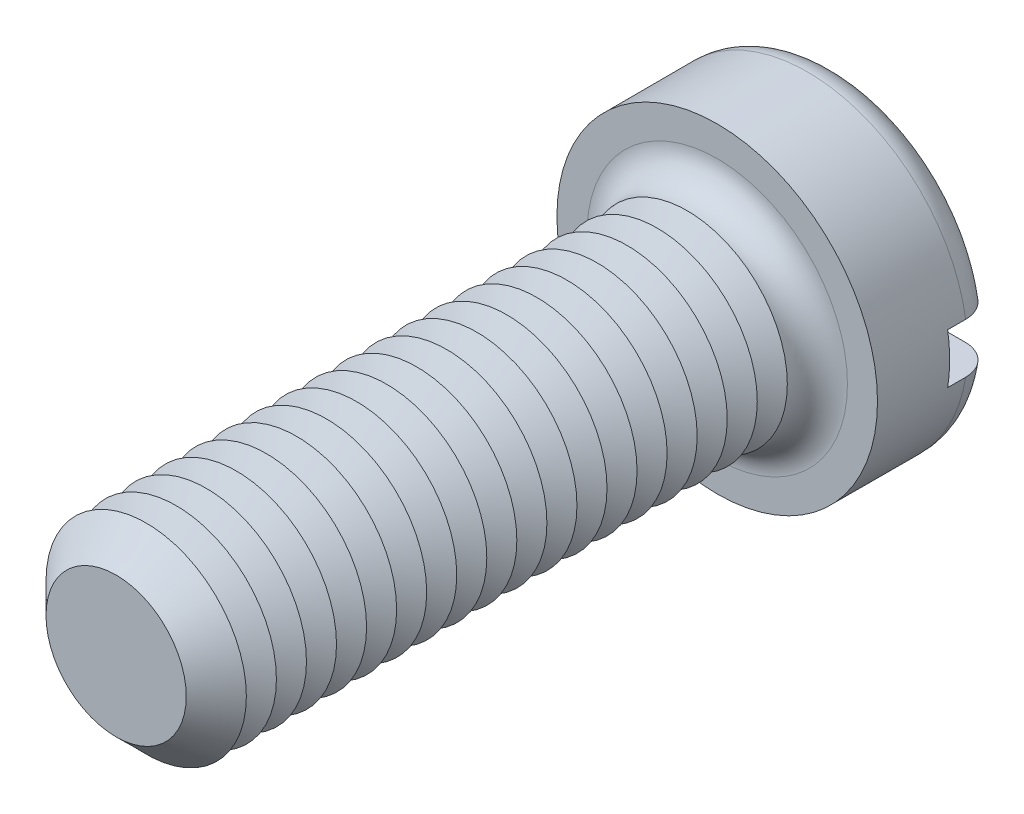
ISO-10303-21;
HEADER;
FILE_DESCRIPTION(('STEP AP214'),'2;1');
FILE_NAME('part.step','',(''),(''),'','','');
FILE_SCHEMA(('AUTOMOTIVE_DESIGN { 1 0 10303 214 1 1 1 1 }'));
ENDSEC;
DATA;
#1=APPLICATION_CONTEXT('core data for automotive mechanical design processes');
#2=APPLICATION_PROTOCOL_DEFINITION('international standard','automotive_design',2000,#1);
#3=PRODUCT_CONTEXT('',#1,'mechanical');
#4=PRODUCT('Part','Part','',(#3));
#5=PRODUCT_RELATED_PRODUCT_CATEGORY('part','',(#4));
#6=PRODUCT_DEFINITION_FORMATION('','',#4);
#7=PRODUCT_DEFINITION_CONTEXT('part definition',#1,'design');
#8=PRODUCT_DEFINITION('design','',#6,#7);
#9=PRODUCT_DEFINITION_SHAPE('','',#8);
#10=(LENGTH_UNIT() NAMED_UNIT(*) SI_UNIT(.MILLI.,.METRE.));
#11=(NAMED_UNIT(*) PLANE_ANGLE_UNIT() SI_UNIT($,.RADIAN.));
#12=(NAMED_UNIT(*) SI_UNIT($,.STERADIAN.) SOLID_ANGLE_UNIT());
#13=UNCERTAINTY_MEASURE_WITH_UNIT(LENGTH_MEASURE(1.E-05),#10,'distance_accuracy_value','');
#14=(GEOMETRIC_REPRESENTATION_CONTEXT(3) GLOBAL_UNCERTAINTY_ASSIGNED_CONTEXT((#13)) GLOBAL_UNIT_ASSIGNED_CONTEXT((#10,
#11,#12)) REPRESENTATION_CONTEXT('',''));
#15=CARTESIAN_POINT('',(0.,0.,0.));
#16=DIRECTION('',(0.,0.,1.));
#17=DIRECTION('',(1.,0.,0.));
#18=AXIS2_PLACEMENT_3D('',#15,#16,#17);
#19=CARTESIAN_POINT('',(0.,0.,-6.));
#20=DIRECTION('',(0.,0.,1.));
#21=DIRECTION('',(1.,0.,0.));
#22=AXIS2_PLACEMENT_3D('',#19,#20,#21);
#23=PLANE('',#22);
#24=CARTESIAN_POINT('',(0.,0.,-6.));
#25=DIRECTION('',(0.,0.,1.));
#26=DIRECTION('',(1.,0.,0.));
#27=AXIS2_PLACEMENT_3D('',#24,#25,#26);
#28=CIRCLE('',#27,6.5);
#29=CARTESIAN_POINT('',(-6.37867541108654,1.25,-6.));
#30=VERTEX_POINT('',#29);
#31=CARTESIAN_POINT('',(6.37867541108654,1.25,-6.));
#32=VERTEX_POINT('',#31);
#33=EDGE_CURVE('E116',#30,#32,#28,.F.);
#34=ORIENTED_EDGE('',*,*,#33,.T.);
#35=DIRECTION('',(1.,0.,0.));
#36=VECTOR('',#35,1.);
#37=CARTESIAN_POINT('',(-8.,1.25,-6.));
#38=LINE('',#37,#36);
#39=EDGE_CURVE('E111',#30,#32,#38,.T.);
#40=ORIENTED_EDGE('',*,*,#39,.F.);
#41=EDGE_LOOP('',(#34,#40));
#42=FACE_BOUND('',#41,.T.);
#43=ADVANCED_FACE('F39',(#42),#23,.F.);
#44=CARTESIAN_POINT('',(0.,0.,-4.5));
#45=DIRECTION('',(0.,0.,1.));
#46=DIRECTION('',(1.,0.,0.));
#47=AXIS2_PLACEMENT_3D('',#44,#45,#46);
#48=TOROIDAL_SURFACE('',#47,6.5,1.5);
#49=CARTESIAN_POINT('',(-7.63778128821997,1.25,-5.34492908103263));
#50=CARTESIAN_POINT('',(-7.58949199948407,1.25,-5.41482553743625));
#51=CARTESIAN_POINT('',(-7.53520056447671,1.25,-5.48065698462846));
#52=CARTESIAN_POINT('',(-7.41624971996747,1.25,-5.60228223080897));
#53=CARTESIAN_POINT('',(-7.35157642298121,1.25,-5.65806236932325));
#54=CARTESIAN_POINT('',(-7.21387612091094,1.25,-5.75795436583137));
#55=CARTESIAN_POINT('',(-7.14085828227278,1.25,-5.80207885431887));
#56=CARTESIAN_POINT('',(-6.98853766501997,1.25,-5.87758013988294));
#57=CARTESIAN_POINT('',(-6.90923642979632,1.25,-5.90896005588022));
#58=CARTESIAN_POINT('',(-6.74565677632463,1.25,-5.95849861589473));
#59=CARTESIAN_POINT('',(-6.66133328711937,1.25,-5.97650838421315));
#60=CARTESIAN_POINT('',(-6.49086565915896,1.25,-5.99833509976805));
#61=CARTESIAN_POINT('',(-6.40472129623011,1.25,-6.00215028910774));
#62=CARTESIAN_POINT('',(-6.23174891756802,1.25,-5.99550457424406));
#63=CARTESIAN_POINT('',(-6.14492874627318,1.25,-5.98483870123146));
#64=CARTESIAN_POINT('',(-5.97427268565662,1.25,-5.94920077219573));
#65=CARTESIAN_POINT('',(-5.89043699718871,1.25,-5.92422775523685));
#66=CARTESIAN_POINT('',(-5.72747580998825,1.25,-5.86041051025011));
#67=CARTESIAN_POINT('',(-5.64839123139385,1.25,-5.8214616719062));
#68=CARTESIAN_POINT('',(-5.49793182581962,1.25,-5.73076137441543));
#69=CARTESIAN_POINT('',(-5.42655700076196,1.25,-5.6790099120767));
#70=CARTESIAN_POINT('',(-5.29410028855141,1.25,-5.56444713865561));
#71=CARTESIAN_POINT('',(-5.23295591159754,1.25,-5.50170815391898));
#72=CARTESIAN_POINT('',(-5.12236155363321,1.25,-5.36664720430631));
#73=CARTESIAN_POINT('',(-5.07291010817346,1.25,-5.29432644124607));
#74=CARTESIAN_POINT('',(-4.98836421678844,1.25,-5.14389152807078));
#75=CARTESIAN_POINT('',(-4.95296843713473,1.25,-5.0659468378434));
#76=CARTESIAN_POINT('',(-4.89620356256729,1.25,-4.90510804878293));
#77=CARTESIAN_POINT('',(-4.87483169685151,1.25,-4.82221493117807));
#78=CARTESIAN_POINT('',(-4.8472995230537,1.25,-4.65636387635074));
#79=CARTESIAN_POINT('',(-4.84072446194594,1.25,-4.57347463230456));
#80=CARTESIAN_POINT('',(-4.84179430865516,1.25,-4.40779255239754));
#81=CARTESIAN_POINT('',(-4.84943782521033,1.25,-4.32499970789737));
#82=CARTESIAN_POINT('',(-4.87846819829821,1.25,-4.16301415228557));
#83=CARTESIAN_POINT('',(-4.89966978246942,1.25,-4.08378809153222));
#84=CARTESIAN_POINT('',(-4.95491528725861,1.25,-3.92995334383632));
#85=CARTESIAN_POINT('',(-4.98895983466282,1.25,-3.85534488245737));
#86=CARTESIAN_POINT('',(-5.06928242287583,1.25,-3.71183790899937));
#87=CARTESIAN_POINT('',(-5.11570495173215,1.25,-3.64302036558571));
#88=CARTESIAN_POINT('',(-5.21915370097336,1.25,-3.51388372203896));
#89=CARTESIAN_POINT('',(-5.27618132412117,1.25,-3.45356574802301));
#90=CARTESIAN_POINT('',(-5.40090076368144,1.25,-3.34137671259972));
#91=CARTESIAN_POINT('',(-5.46884305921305,1.25,-3.28978408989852));
#92=CARTESIAN_POINT('',(-5.61225757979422,1.25,-3.19841811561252));
#93=CARTESIAN_POINT('',(-5.68773079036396,1.25,-3.15864631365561));
#94=CARTESIAN_POINT('',(-5.84602026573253,1.25,-3.09111626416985));
#95=CARTESIAN_POINT('',(-5.92896901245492,1.25,-3.06366820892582));
#96=CARTESIAN_POINT('',(-6.09827849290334,1.25,-3.02294686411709));
#97=CARTESIAN_POINT('',(-6.18463944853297,1.25,-3.00967449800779));
#98=CARTESIAN_POINT('',(-6.35914138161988,1.25,-2.99765063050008));
#99=CARTESIAN_POINT('',(-6.4472913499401,1.25,-2.99902877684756));
#100=CARTESIAN_POINT('',(-6.62209547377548,1.25,-3.01665363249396));
#101=CARTESIAN_POINT('',(-6.70874965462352,1.25,-3.03290008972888));
#102=CARTESIAN_POINT('',(-6.87754008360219,1.25,-3.07975247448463));
#103=CARTESIAN_POINT('',(-6.95969991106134,1.25,-3.11027336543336));
#104=CARTESIAN_POINT('',(-7.11762200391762,1.25,-3.18486653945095));
#105=CARTESIAN_POINT('',(-7.19338469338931,1.25,-3.22893792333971));
#106=CARTESIAN_POINT('',(-7.33522754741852,1.25,-3.32873457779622));
#107=CARTESIAN_POINT('',(-7.40142768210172,1.25,-3.38428930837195));
#108=CARTESIAN_POINT('',(-7.52338344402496,1.25,-3.50587739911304));
#109=CARTESIAN_POINT('',(-7.5791399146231,1.25,-3.57190991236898));
#110=CARTESIAN_POINT('',(-7.67774856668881,1.25,-3.71151097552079));
#111=CARTESIAN_POINT('',(-7.72078137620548,1.25,-3.7849519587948));
#112=CARTESIAN_POINT('',(-7.79373860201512,1.25,-3.93807617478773));
#113=CARTESIAN_POINT('',(-7.82366445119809,1.25,-4.01775872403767));
#114=CARTESIAN_POINT('',(-7.86922494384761,1.25,-4.1801114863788));
#115=CARTESIAN_POINT('',(-7.88502105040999,1.25,-4.26273642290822));
#116=CARTESIAN_POINT('',(-7.90243332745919,1.25,-4.42948977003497));
#117=CARTESIAN_POINT('',(-7.90404643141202,1.25,-4.51361850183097));
#118=CARTESIAN_POINT('',(-7.89306914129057,1.25,-4.68049925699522));
#119=CARTESIAN_POINT('',(-7.88055163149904,1.25,-4.76325613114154));
#120=CARTESIAN_POINT('',(-7.84181179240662,1.25,-4.92542124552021));
#121=CARTESIAN_POINT('',(-7.81560657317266,1.25,-5.00483353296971));
#122=CARTESIAN_POINT('',(-7.76329893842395,1.25,-5.12766777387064));
#123=CARTESIAN_POINT('',(-7.74127773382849,1.25,-5.17287245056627));
#124=CARTESIAN_POINT('',(-7.69279783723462,1.25,-5.26083500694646));
#125=CARTESIAN_POINT('',(-7.66633917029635,1.25,-5.30359290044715));
#126=CARTESIAN_POINT('',(-7.63778128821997,1.25,-5.34492908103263));
#127=B_SPLINE_CURVE_WITH_KNOTS('',3,(#49,#50,#51,#52,#53,#54,#55,#56,#57,#58,#59,#60,#61,#62,
#63,#64,#65,#66,#67,#68,#69,#70,#71,#72,#73,#74,#75,#76,#77,#78,#79,#80,#81,#82,#83,#84,#85,#86,
#87,#88,#89,#90,#91,#92,#93,#94,#95,#96,#97,#98,#99,#100,#101,#102,#103,#104,#105,#106,#107,
#108,#109,#110,#111,#112,#113,#114,#115,#116,#117,#118,#119,#120,#121,#122,#123,#124,#125,#126),
.UNSPECIFIED.,.T.,.F.,(4,2,2,2,2,2,2,2,2,2,2,2,2,2,2,2,2,2,2,2,2,2,2,2,2,2,2,2,2,2,2,2,2,2,2,2,
2,2,4),(0.,0.254678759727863,0.509701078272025,0.764445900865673,1.01912834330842,
1.27660578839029,1.53411511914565,1.7953075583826,2.05651754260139,2.31972495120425,
2.58293242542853,2.84446831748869,3.10597143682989,3.36151874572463,3.61701554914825,
3.86525656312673,4.11347328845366,4.35836855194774,4.60327576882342,4.8511774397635,
5.0991119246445,5.35387584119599,5.60867314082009,5.86956650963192,6.13047687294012,
6.39369803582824,6.65691473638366,6.91858297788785,7.18023385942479,7.43824706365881,
7.69623942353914,7.95037087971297,8.20447454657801,8.45563599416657,8.70685174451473,
8.95677764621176,9.20639187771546,9.35700761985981,9.50762251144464),.UNSPECIFIED.);
#128=CARTESIAN_POINT('',(-7.90174031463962,1.25,-4.50000000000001));
#129=VERTEX_POINT('',#128);
#130=EDGE_CURVE('E322',#129,#30,#127,.T.);
#131=ORIENTED_EDGE('',*,*,#130,.F.);
#132=CARTESIAN_POINT('',(0.,0.,-4.5));
#133=DIRECTION('',(0.,0.,1.));
#134=DIRECTION('',(1.,0.,0.));
#135=AXIS2_PLACEMENT_3D('',#132,#133,#134);
#136=CIRCLE('',#135,8.);
#137=CARTESIAN_POINT('',(7.90174031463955,1.25,-4.5));
#138=VERTEX_POINT('',#137);
#139=EDGE_CURVE('E124',#138,#129,#136,.T.);
#140=ORIENTED_EDGE('',*,*,#139,.F.);
#141=CARTESIAN_POINT('',(4.95236709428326,1.25,-5.05808354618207));
#142=CARTESIAN_POINT('',(4.98477386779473,1.25,-5.13646278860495));
#143=CARTESIAN_POINT('',(5.02397623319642,1.25,-5.21210974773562));
#144=CARTESIAN_POINT('',(5.11464829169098,1.25,-5.35575180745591));
#145=CARTESIAN_POINT('',(5.16613670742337,1.25,-5.42373499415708));
#146=CARTESIAN_POINT('',(5.27963080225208,1.25,-5.55005899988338));
#147=CARTESIAN_POINT('',(5.34161871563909,1.25,-5.60841578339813));
#148=CARTESIAN_POINT('',(5.47431803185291,1.25,-5.71412381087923));
#149=CARTESIAN_POINT('',(5.545027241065,1.25,-5.76147781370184));
#150=CARTESIAN_POINT('',(5.69469818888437,1.25,-5.84486022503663));
#151=CARTESIAN_POINT('',(5.77379661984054,1.25,-5.88064336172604));
#152=CARTESIAN_POINT('',(5.93682776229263,1.25,-5.93863952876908));
#153=CARTESIAN_POINT('',(6.02076112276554,1.25,-5.96085073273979));
#154=CARTESIAN_POINT('',(6.19235911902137,1.25,-5.99130732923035));
#155=CARTESIAN_POINT('',(6.2800597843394,1.25,-5.99935025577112));
#156=CARTESIAN_POINT('',(6.45556807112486,1.25,-6.00057400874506));
#157=CARTESIAN_POINT('',(6.54337569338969,1.25,-5.99375472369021));
#158=CARTESIAN_POINT('',(6.71642471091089,1.25,-5.96539034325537));
#159=CARTESIAN_POINT('',(6.8016703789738,1.25,-5.94387137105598));
#160=CARTESIAN_POINT('',(6.96726399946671,1.25,-5.8866508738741));
#161=CARTESIAN_POINT('',(7.04761223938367,1.25,-5.85095018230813));
#162=CARTESIAN_POINT('',(7.2000703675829,1.25,-5.7668235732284));
#163=CARTESIAN_POINT('',(7.27226868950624,1.25,-5.71855796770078));
#164=CARTESIAN_POINT('',(7.40737382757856,1.25,-5.61041520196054));
#165=CARTESIAN_POINT('',(7.47028138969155,1.25,-5.55053897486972));
#166=CARTESIAN_POINT('',(7.5840004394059,1.25,-5.42185995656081));
#167=CARTESIAN_POINT('',(7.63498189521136,1.25,-5.35320736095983));
#168=CARTESIAN_POINT('',(7.72451646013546,1.25,-5.20822613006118));
#169=CARTESIAN_POINT('',(7.76307051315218,1.25,-5.13189807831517));
#170=CARTESIAN_POINT('',(7.82615156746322,1.25,-4.97479919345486));
#171=CARTESIAN_POINT('',(7.85085353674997,1.25,-4.89409858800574));
#172=CARTESIAN_POINT('',(7.88624162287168,1.25,-4.72968126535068));
#173=CARTESIAN_POINT('',(7.89692844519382,1.25,-4.64596470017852));
#174=CARTESIAN_POINT('',(7.90393395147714,1.25,-4.47857496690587));
#175=CARTESIAN_POINT('',(7.900361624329,1.25,-4.39490633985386));
#176=CARTESIAN_POINT('',(7.8792027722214,1.25,-4.22936201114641));
#177=CARTESIAN_POINT('',(7.86161649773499,1.25,-4.14748627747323));
#178=CARTESIAN_POINT('',(7.81298565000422,1.25,-3.98793539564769));
#179=CARTESIAN_POINT('',(7.78195585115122,1.25,-3.91025574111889));
#180=CARTESIAN_POINT('',(7.70736418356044,1.25,-3.76116938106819));
#181=CARTESIAN_POINT('',(7.66380211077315,1.25,-3.68976277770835));
#182=CARTESIAN_POINT('',(7.56515173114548,1.25,-3.55480889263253));
#183=CARTESIAN_POINT('',(7.51000119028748,1.25,-3.49130712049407));
#184=CARTESIAN_POINT('',(7.38992820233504,1.25,-3.3743390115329));
#185=CARTESIAN_POINT('',(7.32500529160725,1.25,-3.32087315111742));
#186=CARTESIAN_POINT('',(7.18646521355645,1.25,-3.22483712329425));
#187=CARTESIAN_POINT('',(7.11275872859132,1.25,-3.18239583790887));
#188=CARTESIAN_POINT('',(6.95934489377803,1.25,-3.11028530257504));
#189=CARTESIAN_POINT('',(6.87963710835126,1.25,-3.08061698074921));
#190=CARTESIAN_POINT('',(6.71523243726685,1.25,-3.03442872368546));
#191=CARTESIAN_POINT('',(6.63047940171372,1.25,-3.0181086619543));
#192=CARTESIAN_POINT('',(6.45944163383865,1.25,-2.99971307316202));
#193=CARTESIAN_POINT('',(6.37315677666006,1.25,-2.99763871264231));
#194=CARTESIAN_POINT('',(6.20021063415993,1.25,-3.00779604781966));
#195=CARTESIAN_POINT('',(6.11356117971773,1.25,-3.02022976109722));
#196=CARTESIAN_POINT('',(5.94354092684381,1.25,-3.05935975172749));
#197=CARTESIAN_POINT('',(5.86017035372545,1.25,-3.08605700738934));
#198=CARTESIAN_POINT('',(5.69848536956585,1.25,-3.15322746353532));
#199=CARTESIAN_POINT('',(5.62021039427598,1.25,-3.1937956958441));
#200=CARTESIAN_POINT('',(5.47164170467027,1.25,-3.28758816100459));
#201=CARTESIAN_POINT('',(5.40134797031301,1.25,-3.3408123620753));
#202=CARTESIAN_POINT('',(5.27136483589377,1.25,-3.45806317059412));
#203=CARTESIAN_POINT('',(5.21160120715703,1.25,-3.52200740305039));
#204=CARTESIAN_POINT('',(5.10396941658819,1.25,-3.65922833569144));
#205=CARTESIAN_POINT('',(5.05609917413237,1.25,-3.73250340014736));
#206=CARTESIAN_POINT('',(4.97487058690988,1.25,-3.8844714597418));
#207=CARTESIAN_POINT('',(4.94119529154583,1.25,-3.96299495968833));
#208=CARTESIAN_POINT('',(4.88793322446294,1.25,-4.12470694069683));
#209=CARTESIAN_POINT('',(4.86834741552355,1.25,-4.20789574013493));
#210=CARTESIAN_POINT('',(4.84433446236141,1.25,-4.3740749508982));
#211=CARTESIAN_POINT('',(4.83950391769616,1.25,-4.45700748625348));
#212=CARTESIAN_POINT('',(4.84404021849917,1.25,-4.62240731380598));
#213=CARTESIAN_POINT('',(4.85338770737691,1.25,-4.70487508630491));
#214=CARTESIAN_POINT('',(4.87895619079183,1.25,-4.83246978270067));
#215=CARTESIAN_POINT('',(4.89056704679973,1.25,-4.87856970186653));
#216=CARTESIAN_POINT('',(4.91819711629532,1.25,-4.96942661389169));
#217=CARTESIAN_POINT('',(4.93421619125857,1.25,-5.01418364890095));
#218=CARTESIAN_POINT('',(4.95236709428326,1.25,-5.05808354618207));
#219=B_SPLINE_CURVE_WITH_KNOTS('',3,(#141,#142,#143,#144,#145,#146,#147,#148,#149,#150,#151,
#152,#153,#154,#155,#156,#157,#158,#159,#160,#161,#162,#163,#164,#165,#166,#167,#168,#169,#170,
#171,#172,#173,#174,#175,#176,#177,#178,#179,#180,#181,#182,#183,#184,#185,#186,#187,#188,#189,
#190,#191,#192,#193,#194,#195,#196,#197,#198,#199,#200,#201,#202,#203,#204,#205,#206,#207,#208,
#209,#210,#211,#212,#213,#214,#215,#216,#217,#218),.UNSPECIFIED.,.T.,.F.,(4,2,2,2,2,2,2,2,2,2,2,
2,2,2,2,2,2,2,2,2,2,2,2,2,2,2,2,2,2,2,2,2,2,2,2,2,2,2,4),(0.,0.25426396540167,0.508917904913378,
0.763145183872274,1.01730864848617,1.27655188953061,1.53583000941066,1.79878406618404,
2.06174009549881,2.32423003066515,2.5867045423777,2.84598168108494,3.10523799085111,
3.36053725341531,3.61581712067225,3.8677953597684,4.11976091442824,4.36980428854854,
4.61984319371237,4.86960800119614,5.11937687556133,5.37052303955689,5.62168112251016,
5.87565515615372,6.12964764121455,6.38737709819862,6.64512765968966,6.90651052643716,
7.16791132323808,7.43114013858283,7.69436829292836,7.95565940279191,8.21690477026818,
8.47196060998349,8.72703387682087,8.97506819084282,9.22276418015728,9.36518087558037,
9.50759309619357),.UNSPECIFIED.);
#220=EDGE_CURVE('E324',#32,#138,#219,.T.);
#221=ORIENTED_EDGE('',*,*,#220,.F.);
#222=ORIENTED_EDGE('',*,*,#33,.F.);
#223=EDGE_LOOP('',(#131,#140,#221,#222));
#224=FACE_BOUND('',#223,.T.);
#225=ADVANCED_FACE('F306',(#224),#48,.T.);
#226=CARTESIAN_POINT('',(0.,0.,-6.));
#227=DIRECTION('',(0.,0.,1.));
#228=DIRECTION('',(1.,0.,0.));
#229=AXIS2_PLACEMENT_3D('',#226,#227,#228);
#230=CYLINDRICAL_SURFACE('',#229,8.);
#231=DIRECTION('',(0.,0.,1.));
#232=VECTOR('',#231,1.);
#233=CARTESIAN_POINT('',(7.90174031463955,1.25,-6.));
#234=LINE('',#233,#232);
#235=CARTESIAN_POINT('',(7.90174031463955,1.25,-3.6));
#236=VERTEX_POINT('',#235);
#237=EDGE_CURVE('E340',#138,#236,#234,.T.);
#238=ORIENTED_EDGE('',*,*,#237,.F.);
#239=ORIENTED_EDGE('',*,*,#139,.T.);
#240=DIRECTION('',(0.,0.,1.));
#241=VECTOR('',#240,1.);
#242=CARTESIAN_POINT('',(-7.90174031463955,1.25,-6.));
#243=LINE('',#242,#241);
#244=CARTESIAN_POINT('',(-7.90174031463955,1.25,-3.6));
#245=VERTEX_POINT('',#244);
#246=EDGE_CURVE('E63',#245,#129,#243,.F.);
#247=ORIENTED_EDGE('',*,*,#246,.F.);
#248=CARTESIAN_POINT('',(0.,0.,-3.6));
#249=DIRECTION('',(0.,0.,-1.));
#250=DIRECTION('',(-1.,0.,0.));
#251=AXIS2_PLACEMENT_3D('',#248,#249,#250);
#252=CIRCLE('',#251,8.);
#253=CARTESIAN_POINT('',(-7.90174031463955,-1.25,-3.6));
#254=VERTEX_POINT('',#253);
#255=EDGE_CURVE('E43',#245,#254,#252,.F.);
#256=ORIENTED_EDGE('',*,*,#255,.T.);
#257=DIRECTION('',(0.,0.,1.));
#258=VECTOR('',#257,1.);
#259=CARTESIAN_POINT('',(-7.90174031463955,-1.25,-6.));
#260=LINE('',#259,#258);
#261=CARTESIAN_POINT('',(-7.9017403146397,-1.25,-4.49999999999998));
#262=VERTEX_POINT('',#261);
#263=EDGE_CURVE('E337',#262,#254,#260,.T.);
#264=ORIENTED_EDGE('',*,*,#263,.F.);
#265=CARTESIAN_POINT('',(7.90174031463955,-1.25,-4.5));
#266=VERTEX_POINT('',#265);
#267=EDGE_CURVE('E126',#262,#266,#136,.T.);
#268=ORIENTED_EDGE('',*,*,#267,.T.);
#269=DIRECTION('',(0.,0.,1.));
#270=VECTOR('',#269,1.);
#271=CARTESIAN_POINT('',(7.90174031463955,-1.25,-6.));
#272=LINE('',#271,#270);
#273=CARTESIAN_POINT('',(7.90174031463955,-1.25,-3.6));
#274=VERTEX_POINT('',#273);
#275=EDGE_CURVE('E55',#274,#266,#272,.F.);
#276=ORIENTED_EDGE('',*,*,#275,.F.);
#277=EDGE_CURVE('E11',#274,#236,#252,.F.);
#278=ORIENTED_EDGE('',*,*,#277,.T.);
#279=EDGE_LOOP('',(#238,#239,#247,#256,#264,#268,#276,#278));
#280=FACE_BOUND('',#279,.T.);
#281=CARTESIAN_POINT('',(0.,0.,0.));
#282=DIRECTION('',(0.,0.,1.));
#283=DIRECTION('',(1.,0.,0.));
#284=AXIS2_PLACEMENT_3D('',#281,#282,#283);
#285=CIRCLE('',#284,8.);
#286=CARTESIAN_POINT('',(8.,0.,0.));
#287=VERTEX_POINT('',#286);
#288=EDGE_CURVE('E343',#287,#287,#285,.T.);
#289=ORIENTED_EDGE('',*,*,#288,.F.);
#290=EDGE_LOOP('',(#289));
#291=FACE_BOUND('',#290,.T.);
#292=ADVANCED_FACE('F302',(#280,#291),#230,.T.);
#293=CARTESIAN_POINT('',(6.37867541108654,-1.25,-6.));
#294=VERTEX_POINT('',#293);
#295=CARTESIAN_POINT('',(-6.37867541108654,-1.25,-6.));
#296=VERTEX_POINT('',#295);
#297=EDGE_CURVE('E109',#294,#296,#28,.F.);
#298=ORIENTED_EDGE('',*,*,#297,.T.);
#299=DIRECTION('',(-1.,0.,0.));
#300=VECTOR('',#299,1.);
#301=CARTESIAN_POINT('',(-8.,-1.25,-6.));
#302=LINE('',#301,#300);
#303=EDGE_CURVE('E96',#294,#296,#302,.T.);
#304=ORIENTED_EDGE('',*,*,#303,.F.);
#305=EDGE_LOOP('',(#298,#304));
#306=FACE_BOUND('',#305,.T.);
#307=ADVANCED_FACE('F108',(#306),#23,.F.);
#308=CARTESIAN_POINT('',(0.,0.,0.));
#309=DIRECTION('',(0.,0.,1.));
#310=DIRECTION('',(1.,0.,0.));
#311=AXIS2_PLACEMENT_3D('',#308,#309,#310);
#312=PLANE('',#311);
#313=CARTESIAN_POINT('',(0.,0.,0.));
#314=DIRECTION('',(0.,0.,1.));
#315=DIRECTION('',(1.,0.,0.));
#316=AXIS2_PLACEMENT_3D('',#313,#314,#315);
#317=CIRCLE('',#316,6.5);
#318=CARTESIAN_POINT('',(6.5,0.,0.));
#319=VERTEX_POINT('',#318);
#320=EDGE_CURVE('E115',#319,#319,#317,.F.);
#321=ORIENTED_EDGE('',*,*,#320,.T.);
#322=EDGE_LOOP('',(#321));
#323=FACE_BOUND('',#322,.T.);
#324=ORIENTED_EDGE('',*,*,#288,.T.);
#325=EDGE_LOOP('',(#324));
#326=FACE_BOUND('',#325,.T.);
#327=ADVANCED_FACE('F301',(#323,#326),#312,.T.);
#328=CARTESIAN_POINT('',(-7.63778128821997,-1.25,-5.34492908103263));
#329=CARTESIAN_POINT('',(-7.68527581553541,-1.25,-5.27616964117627));
#330=CARTESIAN_POINT('',(-7.72703224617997,-1.25,-5.20337764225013));
#331=CARTESIAN_POINT('',(-7.79778035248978,-1.25,-5.05176511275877));
#332=CARTESIAN_POINT('',(-7.82675823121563,-1.25,-4.97293817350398));
#333=CARTESIAN_POINT('',(-7.87103239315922,-1.25,-4.81153865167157));
#334=CARTESIAN_POINT('',(-7.8863313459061,-1.25,-4.72896680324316));
#335=CARTESIAN_POINT('',(-7.90278562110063,-1.25,-4.56244566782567));
#336=CARTESIAN_POINT('',(-7.90394420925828,-1.25,-4.4784967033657));
#337=CARTESIAN_POINT('',(-7.89211470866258,-1.25,-4.31190980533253));
#338=CARTESIAN_POINT('',(-7.87917806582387,-1.25,-4.22926821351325));
#339=CARTESIAN_POINT('',(-7.8396278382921,-1.25,-4.06732477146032));
#340=CARTESIAN_POINT('',(-7.81301388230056,-1.25,-3.98802301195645));
#341=CARTESIAN_POINT('',(-7.74686575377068,-1.25,-3.83490116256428));
#342=CARTESIAN_POINT('',(-7.70731700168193,-1.25,-3.76108737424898));
#343=CARTESIAN_POINT('',(-7.61647675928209,-1.25,-3.62108231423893));
#344=CARTESIAN_POINT('',(-7.56518496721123,-1.25,-3.55489123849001));
#345=CARTESIAN_POINT('',(-7.45192141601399,-1.25,-3.43145488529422));
#346=CARTESIAN_POINT('',(-7.3898717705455,-1.25,-3.37428109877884));
#347=CARTESIAN_POINT('',(-7.25715883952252,-1.25,-3.27100737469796));
#348=CARTESIAN_POINT('',(-7.18649507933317,-1.25,-3.22490804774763));
#349=CARTESIAN_POINT('',(-7.03760898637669,-1.25,-3.14445316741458));
#350=CARTESIAN_POINT('',(-6.95930204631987,-1.25,-3.1102542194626));
#351=CARTESIAN_POINT('',(-6.79811453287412,-1.25,-3.05526915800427));
#352=CARTESIAN_POINT('',(-6.71523359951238,-1.25,-3.03448410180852));
#353=CARTESIAN_POINT('',(-6.5459165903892,-1.25,-3.006592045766));
#354=CARTESIAN_POINT('',(-6.45944575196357,-1.25,-2.99969602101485));
#355=CARTESIAN_POINT('',(-6.28655568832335,-1.25,-3.00032465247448));
#356=CARTESIAN_POINT('',(-6.20013646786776,-1.25,-3.00785047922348));
#357=CARTESIAN_POINT('',(-6.02865505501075,-1.25,-3.03725742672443));
#358=CARTESIAN_POINT('',(-5.94362352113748,-1.25,-3.05931758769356));
#359=CARTESIAN_POINT('',(-5.77844448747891,-1.25,-3.11735373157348));
#360=CARTESIAN_POINT('',(-5.69829723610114,-1.25,-3.15333042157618));
#361=CARTESIAN_POINT('',(-5.54495924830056,-1.25,-3.23837037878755));
#362=CARTESIAN_POINT('',(-5.47178958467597,-1.25,-3.28747168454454));
#363=CARTESIAN_POINT('',(-5.33486536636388,-1.25,-3.39741183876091));
#364=CARTESIAN_POINT('',(-5.27111040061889,-1.25,-3.45825017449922));
#365=CARTESIAN_POINT('',(-5.15579778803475,-1.25,-3.58914722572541));
#366=CARTESIAN_POINT('',(-5.10409113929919,-1.25,-3.65907455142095));
#367=CARTESIAN_POINT('',(-5.01353659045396,-1.25,-3.8068142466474));
#368=CARTESIAN_POINT('',(-4.97468647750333,-1.25,-3.88462525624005));
#369=CARTESIAN_POINT('',(-4.91208858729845,-1.25,-4.04366636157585));
#370=CARTESIAN_POINT('',(-4.88795969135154,-1.25,-4.12474643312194));
#371=CARTESIAN_POINT('',(-4.85404909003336,-1.25,-4.28985038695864));
#372=CARTESIAN_POINT('',(-4.84426486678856,-1.25,-4.37387374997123));
#373=CARTESIAN_POINT('',(-4.83946276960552,-1.25,-4.54023897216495));
#374=CARTESIAN_POINT('',(-4.8440833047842,-1.25,-4.62257060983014));
#375=CARTESIAN_POINT('',(-4.86713763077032,-1.25,-4.78527148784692));
#376=CARTESIAN_POINT('',(-4.88557092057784,-1.25,-4.86564079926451));
#377=CARTESIAN_POINT('',(-4.9355229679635,-1.25,-5.02189555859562));
#378=CARTESIAN_POINT('',(-4.9669975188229,-1.25,-5.09779517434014));
#379=CARTESIAN_POINT('',(-5.04199393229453,-1.25,-5.24338322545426));
#380=CARTESIAN_POINT('',(-5.0855168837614,-1.25,-5.31307109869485));
#381=CARTESIAN_POINT('',(-5.18427540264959,-1.25,-5.44580979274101));
#382=CARTESIAN_POINT('',(-5.2397318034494,-1.25,-5.50869620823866));
#383=CARTESIAN_POINT('',(-5.36015301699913,-1.25,-5.62458635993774));
#384=CARTESIAN_POINT('',(-5.42511919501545,-1.25,-5.67758867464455));
#385=CARTESIAN_POINT('',(-5.56469412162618,-1.25,-5.7737610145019));
#386=CARTESIAN_POINT('',(-5.6395232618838,-1.25,-5.81661133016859));
#387=CARTESIAN_POINT('',(-5.79521544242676,-1.25,-5.8894110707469));
#388=CARTESIAN_POINT('',(-5.8760791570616,-1.25,-5.91935905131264));
#389=CARTESIAN_POINT('',(-6.04317815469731,-1.25,-5.9660059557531));
#390=CARTESIAN_POINT('',(-6.12948555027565,-1.25,-5.98244700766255));
#391=CARTESIAN_POINT('',(-6.30363462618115,-1.25,-6.00064866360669));
#392=CARTESIAN_POINT('',(-6.39147629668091,-1.25,-6.00240936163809));
#393=CARTESIAN_POINT('',(-6.5664192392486,-1.25,-5.9911248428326));
#394=CARTESIAN_POINT('',(-6.653518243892,-1.25,-5.9780442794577));
#395=CARTESIAN_POINT('',(-6.82426167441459,-1.25,-5.93729204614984));
#396=CARTESIAN_POINT('',(-6.90790538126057,-1.25,-5.90961735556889));
#397=CARTESIAN_POINT('',(-7.06846412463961,-1.25,-5.84071272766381));
#398=CARTESIAN_POINT('',(-7.14543542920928,-1.25,-5.79961377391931));
#399=CARTESIAN_POINT('',(-7.29116896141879,-1.25,-5.70491210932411));
#400=CARTESIAN_POINT('',(-7.35994165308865,-1.25,-5.65132560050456));
#401=CARTESIAN_POINT('',(-7.46362894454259,-1.25,-5.55509815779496));
#402=CARTESIAN_POINT('',(-7.50165191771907,-1.25,-5.51575032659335));
#403=CARTESIAN_POINT('',(-7.57319530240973,-1.25,-5.43315308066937));
#404=CARTESIAN_POINT('',(-7.60671575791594,-1.25,-5.38990370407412));
#405=CARTESIAN_POINT('',(-7.63778128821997,-1.25,-5.34492908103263));
#406=B_SPLINE_CURVE_WITH_KNOTS('',3,(#328,#329,#330,#331,#332,#333,#334,#335,#336,#337,#338,
#339,#340,#341,#342,#343,#344,#345,#346,#347,#348,#349,#350,#351,#352,#353,#354,#355,#356,#357,
#358,#359,#360,#361,#362,#363,#364,#365,#366,#367,#368,#369,#370,#371,#372,#373,#374,#375,#376,
#377,#378,#379,#380,#381,#382,#383,#384,#385,#386,#387,#388,#389,#390,#391,#392,#393,#394,#395,
#396,#397,#398,#399,#400,#401,#402,#403,#404,#405),.UNSPECIFIED.,.T.,.F.,(4,2,2,2,2,2,2,2,2,2,2,
2,2,2,2,2,2,2,2,2,2,2,2,2,2,2,2,2,2,2,2,2,2,2,2,2,2,2,4),(0.,0.250506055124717,
0.501281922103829,0.752008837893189,1.00267784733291,1.25243500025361,1.50219893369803,
1.75224536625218,2.00229822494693,2.25424343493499,2.50620253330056,2.76136198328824,
3.01654154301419,3.27556891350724,3.53461730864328,3.79691797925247,4.05923197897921,
4.32231463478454,4.5853858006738,4.84500678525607,5.10458306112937,5.3571172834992,
5.60960717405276,5.85581050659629,6.10200490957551,6.34737151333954,6.59276029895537,
6.84315522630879,7.09358613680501,7.35108485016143,7.60861238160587,7.87094926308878,
8.13328446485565,8.39624576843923,8.65926152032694,8.91978401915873,9.17997036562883,
9.34382460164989,9.50767723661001),.UNSPECIFIED.);
#407=EDGE_CURVE('E103',#296,#262,#406,.T.);
#408=ORIENTED_EDGE('',*,*,#407,.F.);
#409=ORIENTED_EDGE('',*,*,#297,.F.);
#410=CARTESIAN_POINT('',(4.95236709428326,-1.25,-5.05808354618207));
#411=CARTESIAN_POINT('',(4.92105512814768,-1.25,-4.98233216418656));
#412=CARTESIAN_POINT('',(4.89604361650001,-1.25,-4.90392040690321));
#413=CARTESIAN_POINT('',(4.85951223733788,-1.25,-4.74395758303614));
#414=CARTESIAN_POINT('',(4.8480045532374,-1.25,-4.66240375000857));
#415=CARTESIAN_POINT('',(4.83891469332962,-1.25,-4.49852199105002));
#416=CARTESIAN_POINT('',(4.84133145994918,-1.25,-4.41619412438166));
#417=CARTESIAN_POINT('',(4.8600038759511,-1.25,-4.25314313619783));
#418=CARTESIAN_POINT('',(4.87625705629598,-1.25,-4.17241973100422));
#419=CARTESIAN_POINT('',(4.92196554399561,-1.25,-4.01505032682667));
#420=CARTESIAN_POINT('',(4.95138456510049,-1.25,-3.93839376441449));
#421=CARTESIAN_POINT('',(5.02244158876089,-1.25,-3.79097367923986));
#422=CARTESIAN_POINT('',(5.06408092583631,-1.25,-3.72021080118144));
#423=CARTESIAN_POINT('',(5.15918188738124,-1.25,-3.5851203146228));
#424=CARTESIAN_POINT('',(5.21285223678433,-1.25,-3.5209397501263));
#425=CARTESIAN_POINT('',(5.32993512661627,-1.25,-3.40218700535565));
#426=CARTESIAN_POINT('',(5.39334903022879,-1.25,-3.34761617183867));
#427=CARTESIAN_POINT('',(5.5300552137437,-1.25,-3.24801679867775));
#428=CARTESIAN_POINT('',(5.60357647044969,-1.25,-3.20330242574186));
#429=CARTESIAN_POINT('',(5.75697062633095,-1.25,-3.1265687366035));
#430=CARTESIAN_POINT('',(5.83684424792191,-1.25,-3.09455086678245));
#431=CARTESIAN_POINT('',(6.00239031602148,-1.25,-3.04353393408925));
#432=CARTESIAN_POINT('',(6.08814636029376,-1.25,-3.02480570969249));
#433=CARTESIAN_POINT('',(6.26158564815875,-1.25,-3.00194915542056));
#434=CARTESIAN_POINT('',(6.34926896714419,-1.25,-2.997821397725));
#435=CARTESIAN_POINT('',(6.52441816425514,-1.25,-3.00435236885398));
#436=CARTESIAN_POINT('',(6.61188199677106,-1.25,-3.01506655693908));
#437=CARTESIAN_POINT('',(6.78373130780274,-1.25,-3.05116556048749));
#438=CARTESIAN_POINT('',(6.8681168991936,-1.25,-3.07654983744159));
#439=CARTESIAN_POINT('',(7.03056473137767,-1.25,-3.14105639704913));
#440=CARTESIAN_POINT('',(7.10867812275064,-1.25,-3.18004978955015));
#441=CARTESIAN_POINT('',(7.25711285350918,-1.25,-3.27078804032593));
#442=CARTESIAN_POINT('',(7.327434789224,-1.25,-3.32253192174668));
#443=CARTESIAN_POINT('',(7.45716954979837,-1.25,-3.4364775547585));
#444=CARTESIAN_POINT('',(7.51672925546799,-1.25,-3.49851206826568));
#445=CARTESIAN_POINT('',(7.62440498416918,-1.25,-3.63182557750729));
#446=CARTESIAN_POINT('',(7.67252193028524,-1.25,-3.70310382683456));
#447=CARTESIAN_POINT('',(7.75523498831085,-1.25,-3.8517825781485));
#448=CARTESIAN_POINT('',(7.79001407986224,-1.25,-3.92908131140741));
#449=CARTESIAN_POINT('',(7.84595474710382,-1.25,-4.08845836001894));
#450=CARTESIAN_POINT('',(7.86711715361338,-1.25,-4.1705363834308));
#451=CARTESIAN_POINT('',(7.89503817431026,-1.25,-4.3362768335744));
#452=CARTESIAN_POINT('',(7.90193595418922,-1.25,-4.41991584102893));
#453=CARTESIAN_POINT('',(7.90153623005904,-1.25,-4.58715860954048));
#454=CARTESIAN_POINT('',(7.89423915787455,-1.25,-4.67076237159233));
#455=CARTESIAN_POINT('',(7.86572271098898,-1.25,-4.83525080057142));
#456=CARTESIAN_POINT('',(7.84455307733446,-1.25,-4.91614410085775));
#457=CARTESIAN_POINT('',(7.78897430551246,-1.25,-5.0732444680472));
#458=CARTESIAN_POINT('',(7.75456511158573,-1.25,-5.1494515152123));
#459=CARTESIAN_POINT('',(7.67339923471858,-1.25,-5.29528903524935));
#460=CARTESIAN_POINT('',(7.62660424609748,-1.25,-5.36489817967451));
#461=CARTESIAN_POINT('',(7.52209201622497,-1.25,-5.49536318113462));
#462=CARTESIAN_POINT('',(7.4643743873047,-1.25,-5.55621872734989));
#463=CARTESIAN_POINT('',(7.33909994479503,-1.25,-5.66807257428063));
#464=CARTESIAN_POINT('',(7.27145672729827,-1.25,-5.71897407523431));
#465=CARTESIAN_POINT('',(7.12868060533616,-1.25,-5.80887807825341));
#466=CARTESIAN_POINT('',(7.0535472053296,-1.25,-5.84787979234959));
#467=CARTESIAN_POINT('',(6.89682225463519,-1.25,-5.91345911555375));
#468=CARTESIAN_POINT('',(6.81515596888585,-1.25,-5.93985808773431));
#469=CARTESIAN_POINT('',(6.64858434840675,-1.25,-5.97879449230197));
#470=CARTESIAN_POINT('',(6.56367874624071,-1.25,-5.99133077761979));
#471=CARTESIAN_POINT('',(6.39168259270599,-1.25,-6.00236627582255));
#472=CARTESIAN_POINT('',(6.30457835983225,-1.25,-6.00065255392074));
#473=CARTESIAN_POINT('',(6.13186422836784,-1.25,-5.98278857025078));
#474=CARTESIAN_POINT('',(6.04625438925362,-1.25,-5.96663773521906));
#475=CARTESIAN_POINT('',(5.87802521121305,-1.25,-5.92012173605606));
#476=CARTESIAN_POINT('',(5.79544617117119,-1.25,-5.88961066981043));
#477=CARTESIAN_POINT('',(5.63656223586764,-1.25,-5.81513349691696));
#478=CARTESIAN_POINT('',(5.56025908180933,-1.25,-5.77116367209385));
#479=CARTESIAN_POINT('',(5.4162607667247,-1.25,-5.67098882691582));
#480=CARTESIAN_POINT('',(5.34855795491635,-1.25,-5.61479480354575));
#481=CARTESIAN_POINT('',(5.22382615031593,-1.25,-5.49168804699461));
#482=CARTESIAN_POINT('',(5.16678340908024,-1.25,-5.42478932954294));
#483=CARTESIAN_POINT('',(5.08326589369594,-1.25,-5.3075481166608));
#484=CARTESIAN_POINT('',(5.05313168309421,-1.25,-5.25976959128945));
#485=CARTESIAN_POINT('',(4.99845900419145,-1.25,-5.16110869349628));
#486=CARTESIAN_POINT('',(4.9739204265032,-1.25,-5.11022638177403));
#487=CARTESIAN_POINT('',(4.95236709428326,-1.25,-5.05808354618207));
#488=B_SPLINE_CURVE_WITH_KNOTS('',3,(#410,#411,#412,#413,#414,#415,#416,#417,#418,#419,#420,
#421,#422,#423,#424,#425,#426,#427,#428,#429,#430,#431,#432,#433,#434,#435,#436,#437,#438,#439,
#440,#441,#442,#443,#444,#445,#446,#447,#448,#449,#450,#451,#452,#453,#454,#455,#456,#457,#458,
#459,#460,#461,#462,#463,#464,#465,#466,#467,#468,#469,#470,#471,#472,#473,#474,#475,#476,#477,
#478,#479,#480,#481,#482,#483,#484,#485,#486,#487),.UNSPECIFIED.,.T.,.F.,(4,2,2,2,2,2,2,2,2,2,2,
2,2,2,2,2,2,2,2,2,2,2,2,2,2,2,2,2,2,2,2,2,2,2,2,2,2,2,4),(0.,0.245701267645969,
0.491624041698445,0.737528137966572,0.983388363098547,1.22857510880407,1.47378864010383,
1.72364048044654,1.97352730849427,2.2304941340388,2.48749022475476,2.74958408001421,
3.01168820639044,3.2747743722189,3.53785088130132,3.79850056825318,4.05913029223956,
4.31587819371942,4.57260537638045,4.82567253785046,5.07872425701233,5.32929532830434,
5.57985877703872,5.82952869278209,6.07919966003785,6.32965199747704,6.58011322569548,
6.8329006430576,7.08570479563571,7.3419930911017,7.59830259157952,7.85844887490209,
8.11860548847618,8.38146435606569,8.64439590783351,8.90709189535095,9.16944670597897,
9.33857644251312,9.5077028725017),.UNSPECIFIED.);
#489=EDGE_CURVE('E92',#266,#294,#488,.T.);
#490=ORIENTED_EDGE('',*,*,#489,.F.);
#491=ORIENTED_EDGE('',*,*,#267,.F.);
#492=EDGE_LOOP('',(#408,#409,#490,#491));
#493=FACE_BOUND('',#492,.T.);
#494=ADVANCED_FACE('F113',(#493),#48,.T.);
#495=CARTESIAN_POINT('',(0.,0.,1.5));
#496=DIRECTION('',(0.,0.,1.));
#497=DIRECTION('',(1.,0.,0.));
#498=AXIS2_PLACEMENT_3D('',#495,#496,#497);
#499=TOROIDAL_SURFACE('',#498,6.5,1.5);
#500=ORIENTED_EDGE('',*,*,#320,.F.);
#501=EDGE_LOOP('',(#500));
#502=FACE_BOUND('',#501,.T.);
#503=CARTESIAN_POINT('',(0.,0.,1.5));
#504=DIRECTION('',(0.,0.,-1.));
#505=DIRECTION('',(-1.,0.,0.));
#506=AXIS2_PLACEMENT_3D('',#503,#504,#505);
#507=CIRCLE('',#506,5.);
#508=CARTESIAN_POINT('',(-5.,0.,1.5));
#509=VERTEX_POINT('',#508);
#510=EDGE_CURVE('E348',#509,#509,#507,.T.);
#511=ORIENTED_EDGE('',*,*,#510,.T.);
#512=EDGE_LOOP('',(#511));
#513=FACE_BOUND('',#512,.T.);
#514=ADVANCED_FACE('F294',(#502,#513),#499,.F.);
#515=CARTESIAN_POINT('',(0.,0.,2.25));
#516=DIRECTION('',(0.,0.,-1.));
#517=DIRECTION('',(-1.,0.,0.));
#518=AXIS2_PLACEMENT_3D('',#515,#516,#517);
#519=CONICAL_SURFACE('',#518,3.70096189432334,1.0471975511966);
#520=ORIENTED_EDGE('',*,*,#510,.F.);
#521=EDGE_LOOP('',(#520));
#522=FACE_BOUND('',#521,.T.);
#523=CARTESIAN_POINT('',(0.,0.,2.25));
#524=DIRECTION('',(0.,0.,-1.));
#525=DIRECTION('',(-1.,0.,0.));
#526=AXIS2_PLACEMENT_3D('',#523,#524,#525);
#527=CIRCLE('',#526,3.70096189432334);
#528=CARTESIAN_POINT('',(-3.70096189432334,0.,2.25));
#529=VERTEX_POINT('',#528);
#530=EDGE_CURVE('E354',#529,#529,#527,.T.);
#531=ORIENTED_EDGE('',*,*,#530,.T.);
#532=EDGE_LOOP('',(#531));
#533=FACE_BOUND('',#532,.T.);
#534=ADVANCED_FACE('F290',(#522,#533),#519,.T.);
#535=CARTESIAN_POINT('',(0.,0.,3.));
#536=DIRECTION('',(0.,0.,1.));
#537=DIRECTION('',(1.,0.,0.));
#538=AXIS2_PLACEMENT_3D('',#535,#536,#537);
#539=CONICAL_SURFACE('',#538,5.,1.0471975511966);
#540=ORIENTED_EDGE('',*,*,#530,.F.);
#541=EDGE_LOOP('',(#540));
#542=FACE_BOUND('',#541,.T.);
#543=CARTESIAN_POINT('',(0.,0.,3.));
#544=DIRECTION('',(0.,0.,-1.));
#545=DIRECTION('',(-1.,0.,0.));
#546=AXIS2_PLACEMENT_3D('',#543,#544,#545);
#547=CIRCLE('',#546,5.);
#548=CARTESIAN_POINT('',(-5.,0.,3.));
#549=VERTEX_POINT('',#548);
#550=EDGE_CURVE('E360',#549,#549,#547,.T.);
#551=ORIENTED_EDGE('',*,*,#550,.T.);
#552=EDGE_LOOP('',(#551));
#553=FACE_BOUND('',#552,.T.);
#554=ADVANCED_FACE('F286',(#542,#553),#539,.T.);
#555=CARTESIAN_POINT('',(0.,0.,3.75));
#556=DIRECTION('',(0.,0.,-1.));
#557=DIRECTION('',(-1.,0.,0.));
#558=AXIS2_PLACEMENT_3D('',#555,#556,#557);
#559=CONICAL_SURFACE('',#558,3.70096189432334,1.0471975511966);
#560=ORIENTED_EDGE('',*,*,#550,.F.);
#561=EDGE_LOOP('',(#560));
#562=FACE_BOUND('',#561,.T.);
#563=CARTESIAN_POINT('',(0.,0.,3.75));
#564=DIRECTION('',(0.,0.,-1.));
#565=DIRECTION('',(-1.,0.,0.));
#566=AXIS2_PLACEMENT_3D('',#563,#564,#565);
#567=CIRCLE('',#566,3.70096189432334);
#568=CARTESIAN_POINT('',(-3.70096189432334,0.,3.75));
#569=VERTEX_POINT('',#568);
#570=EDGE_CURVE('E364',#569,#569,#567,.T.);
#571=ORIENTED_EDGE('',*,*,#570,.T.);
#572=EDGE_LOOP('',(#571));
#573=FACE_BOUND('',#572,.T.);
#574=ADVANCED_FACE('F282',(#562,#573),#559,.T.);
#575=CARTESIAN_POINT('',(0.,0.,4.5));
#576=DIRECTION('',(0.,0.,1.));
#577=DIRECTION('',(1.,0.,0.));
#578=AXIS2_PLACEMENT_3D('',#575,#576,#577);
#579=CONICAL_SURFACE('',#578,5.,1.0471975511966);
#580=ORIENTED_EDGE('',*,*,#570,.F.);
#581=EDGE_LOOP('',(#580));
#582=FACE_BOUND('',#581,.T.);
#583=CARTESIAN_POINT('',(0.,0.,4.5));
#584=DIRECTION('',(0.,0.,-1.));
#585=DIRECTION('',(-1.,0.,0.));
#586=AXIS2_PLACEMENT_3D('',#583,#584,#585);
#587=CIRCLE('',#586,5.);
#588=CARTESIAN_POINT('',(-5.,0.,4.5));
#589=VERTEX_POINT('',#588);
#590=EDGE_CURVE('E368',#589,#589,#587,.T.);
#591=ORIENTED_EDGE('',*,*,#590,.T.);
#592=EDGE_LOOP('',(#591));
#593=FACE_BOUND('',#592,.T.);
#594=ADVANCED_FACE('F278',(#582,#593),#579,.T.);
#595=CARTESIAN_POINT('',(0.,0.,5.25));
#596=DIRECTION('',(0.,0.,-1.));
#597=DIRECTION('',(-1.,0.,0.));
#598=AXIS2_PLACEMENT_3D('',#595,#596,#597);
#599=CONICAL_SURFACE('',#598,3.70096189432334,1.0471975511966);
#600=ORIENTED_EDGE('',*,*,#590,.F.);
#601=EDGE_LOOP('',(#600));
#602=FACE_BOUND('',#601,.T.);
#603=CARTESIAN_POINT('',(0.,0.,5.25));
#604=DIRECTION('',(0.,0.,-1.));
#605=DIRECTION('',(-1.,0.,0.));
#606=AXIS2_PLACEMENT_3D('',#603,#604,#605);
#607=CIRCLE('',#606,3.70096189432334);
#608=CARTESIAN_POINT('',(-3.70096189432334,0.,5.25));
#609=VERTEX_POINT('',#608);
#610=EDGE_CURVE('E371',#609,#609,#607,.T.);
#611=ORIENTED_EDGE('',*,*,#610,.T.);
#612=EDGE_LOOP('',(#611));
#613=FACE_BOUND('',#612,.T.);
#614=ADVANCED_FACE('F274',(#602,#613),#599,.T.);
#615=CARTESIAN_POINT('',(0.,0.,6.));
#616=DIRECTION('',(0.,0.,1.));
#617=DIRECTION('',(1.,0.,0.));
#618=AXIS2_PLACEMENT_3D('',#615,#616,#617);
#619=CONICAL_SURFACE('',#618,5.,1.0471975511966);
#620=ORIENTED_EDGE('',*,*,#610,.F.);
#621=EDGE_LOOP('',(#620));
#622=FACE_BOUND('',#621,.T.);
#623=CARTESIAN_POINT('',(0.,0.,6.));
#624=DIRECTION('',(0.,0.,-1.));
#625=DIRECTION('',(-1.,0.,0.));
#626=AXIS2_PLACEMENT_3D('',#623,#624,#625);
#627=CIRCLE('',#626,5.);
#628=CARTESIAN_POINT('',(-5.,0.,6.));
#629=VERTEX_POINT('',#628);
#630=EDGE_CURVE('E375',#629,#629,#627,.T.);
#631=ORIENTED_EDGE('',*,*,#630,.T.);
#632=EDGE_LOOP('',(#631));
#633=FACE_BOUND('',#632,.T.);
#634=ADVANCED_FACE('F270',(#622,#633),#619,.T.);
#635=CARTESIAN_POINT('',(0.,0.,6.75));
#636=DIRECTION('',(0.,0.,-1.));
#637=DIRECTION('',(-1.,0.,0.));
#638=AXIS2_PLACEMENT_3D('',#635,#636,#637);
#639=CONICAL_SURFACE('',#638,3.70096189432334,1.0471975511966);
#640=ORIENTED_EDGE('',*,*,#630,.F.);
#641=EDGE_LOOP('',(#640));
#642=FACE_BOUND('',#641,.T.);
#643=CARTESIAN_POINT('',(0.,0.,6.75));
#644=DIRECTION('',(0.,0.,-1.));
#645=DIRECTION('',(-1.,0.,0.));
#646=AXIS2_PLACEMENT_3D('',#643,#644,#645);
#647=CIRCLE('',#646,3.70096189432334);
#648=CARTESIAN_POINT('',(-3.70096189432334,0.,6.75));
#649=VERTEX_POINT('',#648);
#650=EDGE_CURVE('E378',#649,#649,#647,.T.);
#651=ORIENTED_EDGE('',*,*,#650,.T.);
#652=EDGE_LOOP('',(#651));
#653=FACE_BOUND('',#652,.T.);
#654=ADVANCED_FACE('F266',(#642,#653),#639,.T.);
#655=CARTESIAN_POINT('',(0.,0.,7.5));
#656=DIRECTION('',(0.,0.,1.));
#657=DIRECTION('',(1.,0.,0.));
#658=AXIS2_PLACEMENT_3D('',#655,#656,#657);
#659=CONICAL_SURFACE('',#658,5.,1.0471975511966);
#660=ORIENTED_EDGE('',*,*,#650,.F.);
#661=EDGE_LOOP('',(#660));
#662=FACE_BOUND('',#661,.T.);
#663=CARTESIAN_POINT('',(0.,0.,7.5));
#664=DIRECTION('',(0.,0.,-1.));
#665=DIRECTION('',(-1.,0.,0.));
#666=AXIS2_PLACEMENT_3D('',#663,#664,#665);
#667=CIRCLE('',#666,5.);
#668=CARTESIAN_POINT('',(-5.,0.,7.5));
#669=VERTEX_POINT('',#668);
#670=EDGE_CURVE('E382',#669,#669,#667,.T.);
#671=ORIENTED_EDGE('',*,*,#670,.T.);
#672=EDGE_LOOP('',(#671));
#673=FACE_BOUND('',#672,.T.);
#674=ADVANCED_FACE('F262',(#662,#673),#659,.T.);
#675=CARTESIAN_POINT('',(0.,0.,8.25));
#676=DIRECTION('',(0.,0.,-1.));
#677=DIRECTION('',(-1.,0.,0.));
#678=AXIS2_PLACEMENT_3D('',#675,#676,#677);
#679=CONICAL_SURFACE('',#678,3.70096189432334,1.0471975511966);
#680=ORIENTED_EDGE('',*,*,#670,.F.);
#681=EDGE_LOOP('',(#680));
#682=FACE_BOUND('',#681,.T.);
#683=CARTESIAN_POINT('',(0.,0.,8.25));
#684=DIRECTION('',(0.,0.,-1.));
#685=DIRECTION('',(-1.,0.,0.));
#686=AXIS2_PLACEMENT_3D('',#683,#684,#685);
#687=CIRCLE('',#686,3.70096189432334);
#688=CARTESIAN_POINT('',(-3.70096189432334,0.,8.25));
#689=VERTEX_POINT('',#688);
#690=EDGE_CURVE('E386',#689,#689,#687,.T.);
#691=ORIENTED_EDGE('',*,*,#690,.T.);
#692=EDGE_LOOP('',(#691));
#693=FACE_BOUND('',#692,.T.);
#694=ADVANCED_FACE('F258',(#682,#693),#679,.T.);
#695=CARTESIAN_POINT('',(0.,0.,9.));
#696=DIRECTION('',(0.,0.,1.));
#697=DIRECTION('',(1.,0.,0.));
#698=AXIS2_PLACEMENT_3D('',#695,#696,#697);
#699=CONICAL_SURFACE('',#698,5.,1.0471975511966);
#700=ORIENTED_EDGE('',*,*,#690,.F.);
#701=EDGE_LOOP('',(#700));
#702=FACE_BOUND('',#701,.T.);
#703=CARTESIAN_POINT('',(0.,0.,9.));
#704=DIRECTION('',(0.,0.,-1.));
#705=DIRECTION('',(-1.,0.,0.));
#706=AXIS2_PLACEMENT_3D('',#703,#704,#705);
#707=CIRCLE('',#706,5.);
#708=CARTESIAN_POINT('',(-5.,0.,9.));
#709=VERTEX_POINT('',#708);
#710=EDGE_CURVE('E390',#709,#709,#707,.T.);
#711=ORIENTED_EDGE('',*,*,#710,.T.);
#712=EDGE_LOOP('',(#711));
#713=FACE_BOUND('',#712,.T.);
#714=ADVANCED_FACE('F254',(#702,#713),#699,.T.);
#715=CARTESIAN_POINT('',(0.,0.,9.75));
#716=DIRECTION('',(0.,0.,-1.));
#717=DIRECTION('',(-1.,0.,0.));
#718=AXIS2_PLACEMENT_3D('',#715,#716,#717);
#719=CONICAL_SURFACE('',#718,3.70096189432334,1.0471975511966);
#720=ORIENTED_EDGE('',*,*,#710,.F.);
#721=EDGE_LOOP('',(#720));
#722=FACE_BOUND('',#721,.T.);
#723=CARTESIAN_POINT('',(0.,0.,9.75));
#724=DIRECTION('',(0.,0.,-1.));
#725=DIRECTION('',(-1.,0.,0.));
#726=AXIS2_PLACEMENT_3D('',#723,#724,#725);
#727=CIRCLE('',#726,3.70096189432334);
#728=CARTESIAN_POINT('',(-3.70096189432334,0.,9.75));
#729=VERTEX_POINT('',#728);
#730=EDGE_CURVE('E394',#729,#729,#727,.T.);
#731=ORIENTED_EDGE('',*,*,#730,.T.);
#732=EDGE_LOOP('',(#731));
#733=FACE_BOUND('',#732,.T.);
#734=ADVANCED_FACE('F250',(#722,#733),#719,.T.);
#735=CARTESIAN_POINT('',(0.,0.,10.5));
#736=DIRECTION('',(0.,0.,1.));
#737=DIRECTION('',(1.,0.,0.));
#738=AXIS2_PLACEMENT_3D('',#735,#736,#737);
#739=CONICAL_SURFACE('',#738,5.,1.0471975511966);
#740=ORIENTED_EDGE('',*,*,#730,.F.);
#741=EDGE_LOOP('',(#740));
#742=FACE_BOUND('',#741,.T.);
#743=CARTESIAN_POINT('',(0.,0.,10.5));
#744=DIRECTION('',(0.,0.,-1.));
#745=DIRECTION('',(-1.,0.,0.));
#746=AXIS2_PLACEMENT_3D('',#743,#744,#745);
#747=CIRCLE('',#746,5.);
#748=CARTESIAN_POINT('',(-5.,0.,10.5));
#749=VERTEX_POINT('',#748);
#750=EDGE_CURVE('E397',#749,#749,#747,.T.);
#751=ORIENTED_EDGE('',*,*,#750,.T.);
#752=EDGE_LOOP('',(#751));
#753=FACE_BOUND('',#752,.T.);
#754=ADVANCED_FACE('F246',(#742,#753),#739,.T.);
#755=CARTESIAN_POINT('',(0.,0.,11.25));
#756=DIRECTION('',(0.,0.,-1.));
#757=DIRECTION('',(-1.,0.,0.));
#758=AXIS2_PLACEMENT_3D('',#755,#756,#757);
#759=CONICAL_SURFACE('',#758,3.70096189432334,1.0471975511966);
#760=ORIENTED_EDGE('',*,*,#750,.F.);
#761=EDGE_LOOP('',(#760));
#762=FACE_BOUND('',#761,.T.);
#763=CARTESIAN_POINT('',(0.,0.,11.25));
#764=DIRECTION('',(0.,0.,-1.));
#765=DIRECTION('',(-1.,0.,0.));
#766=AXIS2_PLACEMENT_3D('',#763,#764,#765);
#767=CIRCLE('',#766,3.70096189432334);
#768=CARTESIAN_POINT('',(-3.70096189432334,0.,11.25));
#769=VERTEX_POINT('',#768);
#770=EDGE_CURVE('E401',#769,#769,#767,.T.);
#771=ORIENTED_EDGE('',*,*,#770,.T.);
#772=EDGE_LOOP('',(#771));
#773=FACE_BOUND('',#772,.T.);
#774=ADVANCED_FACE('F242',(#762,#773),#759,.T.);
#775=CARTESIAN_POINT('',(0.,0.,12.));
#776=DIRECTION('',(0.,0.,1.));
#777=DIRECTION('',(1.,0.,0.));
#778=AXIS2_PLACEMENT_3D('',#775,#776,#777);
#779=CONICAL_SURFACE('',#778,5.,1.0471975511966);
#780=ORIENTED_EDGE('',*,*,#770,.F.);
#781=EDGE_LOOP('',(#780));
#782=FACE_BOUND('',#781,.T.);
#783=CARTESIAN_POINT('',(0.,0.,12.));
#784=DIRECTION('',(0.,0.,-1.));
#785=DIRECTION('',(-1.,0.,0.));
#786=AXIS2_PLACEMENT_3D('',#783,#784,#785);
#787=CIRCLE('',#786,5.);
#788=CARTESIAN_POINT('',(-5.,0.,12.));
#789=VERTEX_POINT('',#788);
#790=EDGE_CURVE('E405',#789,#789,#787,.T.);
#791=ORIENTED_EDGE('',*,*,#790,.T.);
#792=EDGE_LOOP('',(#791));
#793=FACE_BOUND('',#792,.T.);
#794=ADVANCED_FACE('F238',(#782,#793),#779,.T.);
#795=CARTESIAN_POINT('',(0.,0.,12.75));
#796=DIRECTION('',(0.,0.,-1.));
#797=DIRECTION('',(-1.,0.,0.));
#798=AXIS2_PLACEMENT_3D('',#795,#796,#797);
#799=CONICAL_SURFACE('',#798,3.70096189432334,1.0471975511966);
#800=ORIENTED_EDGE('',*,*,#790,.F.);
#801=EDGE_LOOP('',(#800));
#802=FACE_BOUND('',#801,.T.);
#803=CARTESIAN_POINT('',(0.,0.,12.75));
#804=DIRECTION('',(0.,0.,-1.));
#805=DIRECTION('',(-1.,0.,0.));
#806=AXIS2_PLACEMENT_3D('',#803,#804,#805);
#807=CIRCLE('',#806,3.70096189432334);
#808=CARTESIAN_POINT('',(-3.70096189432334,0.,12.75));
#809=VERTEX_POINT('',#808);
#810=EDGE_CURVE('E409',#809,#809,#807,.T.);
#811=ORIENTED_EDGE('',*,*,#810,.T.);
#812=EDGE_LOOP('',(#811));
#813=FACE_BOUND('',#812,.T.);
#814=ADVANCED_FACE('F234',(#802,#813),#799,.T.);
#815=CARTESIAN_POINT('',(0.,0.,13.5));
#816=DIRECTION('',(0.,0.,1.));
#817=DIRECTION('',(1.,0.,0.));
#818=AXIS2_PLACEMENT_3D('',#815,#816,#817);
#819=CONICAL_SURFACE('',#818,5.,1.0471975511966);
#820=ORIENTED_EDGE('',*,*,#810,.F.);
#821=EDGE_LOOP('',(#820));
#822=FACE_BOUND('',#821,.T.);
#823=CARTESIAN_POINT('',(0.,0.,13.5));
#824=DIRECTION('',(0.,0.,-1.));
#825=DIRECTION('',(-1.,0.,0.));
#826=AXIS2_PLACEMENT_3D('',#823,#824,#825);
#827=CIRCLE('',#826,5.);
#828=CARTESIAN_POINT('',(-5.,0.,13.5));
#829=VERTEX_POINT('',#828);
#830=EDGE_CURVE('E412',#829,#829,#827,.T.);
#831=ORIENTED_EDGE('',*,*,#830,.T.);
#832=EDGE_LOOP('',(#831));
#833=FACE_BOUND('',#832,.T.);
#834=ADVANCED_FACE('F230',(#822,#833),#819,.T.);
#835=CARTESIAN_POINT('',(0.,0.,14.25));
#836=DIRECTION('',(0.,0.,-1.));
#837=DIRECTION('',(-1.,0.,0.));
#838=AXIS2_PLACEMENT_3D('',#835,#836,#837);
#839=CONICAL_SURFACE('',#838,3.70096189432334,1.0471975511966);
#840=ORIENTED_EDGE('',*,*,#830,.F.);
#841=EDGE_LOOP('',(#840));
#842=FACE_BOUND('',#841,.T.);
#843=CARTESIAN_POINT('',(0.,0.,14.25));
#844=DIRECTION('',(0.,0.,-1.));
#845=DIRECTION('',(-1.,0.,0.));
#846=AXIS2_PLACEMENT_3D('',#843,#844,#845);
#847=CIRCLE('',#846,3.70096189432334);
#848=CARTESIAN_POINT('',(-3.70096189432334,0.,14.25));
#849=VERTEX_POINT('',#848);
#850=EDGE_CURVE('E416',#849,#849,#847,.T.);
#851=ORIENTED_EDGE('',*,*,#850,.T.);
#852=EDGE_LOOP('',(#851));
#853=FACE_BOUND('',#852,.T.);
#854=ADVANCED_FACE('F226',(#842,#853),#839,.T.);
#855=CARTESIAN_POINT('',(0.,0.,15.));
#856=DIRECTION('',(0.,0.,1.));
#857=DIRECTION('',(1.,0.,0.));
#858=AXIS2_PLACEMENT_3D('',#855,#856,#857);
#859=CONICAL_SURFACE('',#858,5.,1.0471975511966);
#860=ORIENTED_EDGE('',*,*,#850,.F.);
#861=EDGE_LOOP('',(#860));
#862=FACE_BOUND('',#861,.T.);
#863=CARTESIAN_POINT('',(0.,0.,15.));
#864=DIRECTION('',(0.,0.,-1.));
#865=DIRECTION('',(-1.,0.,0.));
#866=AXIS2_PLACEMENT_3D('',#863,#864,#865);
#867=CIRCLE('',#866,5.);
#868=CARTESIAN_POINT('',(-5.,0.,15.));
#869=VERTEX_POINT('',#868);
#870=EDGE_CURVE('E420',#869,#869,#867,.T.);
#871=ORIENTED_EDGE('',*,*,#870,.T.);
#872=EDGE_LOOP('',(#871));
#873=FACE_BOUND('',#872,.T.);
#874=ADVANCED_FACE('F222',(#862,#873),#859,.T.);
#875=CARTESIAN_POINT('',(0.,0.,15.75));
#876=DIRECTION('',(0.,0.,-1.));
#877=DIRECTION('',(-1.,0.,0.));
#878=AXIS2_PLACEMENT_3D('',#875,#876,#877);
#879=CONICAL_SURFACE('',#878,3.70096189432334,1.0471975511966);
#880=ORIENTED_EDGE('',*,*,#870,.F.);
#881=EDGE_LOOP('',(#880));
#882=FACE_BOUND('',#881,.T.);
#883=CARTESIAN_POINT('',(0.,0.,15.75));
#884=DIRECTION('',(0.,0.,-1.));
#885=DIRECTION('',(-1.,0.,0.));
#886=AXIS2_PLACEMENT_3D('',#883,#884,#885);
#887=CIRCLE('',#886,3.70096189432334);
#888=CARTESIAN_POINT('',(-3.70096189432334,0.,15.75));
#889=VERTEX_POINT('',#888);
#890=EDGE_CURVE('E424',#889,#889,#887,.T.);
#891=ORIENTED_EDGE('',*,*,#890,.T.);
#892=EDGE_LOOP('',(#891));
#893=FACE_BOUND('',#892,.T.);
#894=ADVANCED_FACE('F218',(#882,#893),#879,.T.);
#895=CARTESIAN_POINT('',(0.,0.,16.5));
#896=DIRECTION('',(0.,0.,1.));
#897=DIRECTION('',(1.,0.,0.));
#898=AXIS2_PLACEMENT_3D('',#895,#896,#897);
#899=CONICAL_SURFACE('',#898,5.,1.0471975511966);
#900=ORIENTED_EDGE('',*,*,#890,.F.);
#901=EDGE_LOOP('',(#900));
#902=FACE_BOUND('',#901,.T.);
#903=CARTESIAN_POINT('',(0.,0.,16.5));
#904=DIRECTION('',(0.,0.,-1.));
#905=DIRECTION('',(-1.,0.,0.));
#906=AXIS2_PLACEMENT_3D('',#903,#904,#905);
#907=CIRCLE('',#906,5.);
#908=CARTESIAN_POINT('',(-5.,0.,16.5));
#909=VERTEX_POINT('',#908);
#910=EDGE_CURVE('E428',#909,#909,#907,.T.);
#911=ORIENTED_EDGE('',*,*,#910,.T.);
#912=EDGE_LOOP('',(#911));
#913=FACE_BOUND('',#912,.T.);
#914=ADVANCED_FACE('F214',(#902,#913),#899,.T.);
#915=CARTESIAN_POINT('',(0.,0.,17.25));
#916=DIRECTION('',(0.,0.,-1.));
#917=DIRECTION('',(-1.,0.,0.));
#918=AXIS2_PLACEMENT_3D('',#915,#916,#917);
#919=CONICAL_SURFACE('',#918,3.70096189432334,1.0471975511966);
#920=ORIENTED_EDGE('',*,*,#910,.F.);
#921=EDGE_LOOP('',(#920));
#922=FACE_BOUND('',#921,.T.);
#923=CARTESIAN_POINT('',(0.,0.,17.25));
#924=DIRECTION('',(0.,0.,-1.));
#925=DIRECTION('',(-1.,0.,0.));
#926=AXIS2_PLACEMENT_3D('',#923,#924,#925);
#927=CIRCLE('',#926,3.70096189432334);
#928=CARTESIAN_POINT('',(-3.70096189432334,0.,17.25));
#929=VERTEX_POINT('',#928);
#930=EDGE_CURVE('E432',#929,#929,#927,.T.);
#931=ORIENTED_EDGE('',*,*,#930,.T.);
#932=EDGE_LOOP('',(#931));
#933=FACE_BOUND('',#932,.T.);
#934=ADVANCED_FACE('F210',(#922,#933),#919,.T.);
#935=CARTESIAN_POINT('',(0.,0.,18.));
#936=DIRECTION('',(0.,0.,1.));
#937=DIRECTION('',(1.,0.,0.));
#938=AXIS2_PLACEMENT_3D('',#935,#936,#937);
#939=CONICAL_SURFACE('',#938,5.,1.0471975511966);
#940=ORIENTED_EDGE('',*,*,#930,.F.);
#941=EDGE_LOOP('',(#940));
#942=FACE_BOUND('',#941,.T.);
#943=CARTESIAN_POINT('',(0.,0.,18.));
#944=DIRECTION('',(0.,0.,-1.));
#945=DIRECTION('',(-1.,0.,0.));
#946=AXIS2_PLACEMENT_3D('',#943,#944,#945);
#947=CIRCLE('',#946,5.);
#948=CARTESIAN_POINT('',(-5.,0.,18.));
#949=VERTEX_POINT('',#948);
#950=EDGE_CURVE('E436',#949,#949,#947,.T.);
#951=ORIENTED_EDGE('',*,*,#950,.T.);
#952=EDGE_LOOP('',(#951));
#953=FACE_BOUND('',#952,.T.);
#954=ADVANCED_FACE('F206',(#942,#953),#939,.T.);
#955=CARTESIAN_POINT('',(0.,0.,18.75));
#956=DIRECTION('',(0.,0.,-1.));
#957=DIRECTION('',(-1.,0.,0.));
#958=AXIS2_PLACEMENT_3D('',#955,#956,#957);
#959=CONICAL_SURFACE('',#958,3.70096189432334,1.0471975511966);
#960=ORIENTED_EDGE('',*,*,#950,.F.);
#961=EDGE_LOOP('',(#960));
#962=FACE_BOUND('',#961,.T.);
#963=CARTESIAN_POINT('',(0.,0.,18.75));
#964=DIRECTION('',(0.,0.,-1.));
#965=DIRECTION('',(-1.,0.,0.));
#966=AXIS2_PLACEMENT_3D('',#963,#964,#965);
#967=CIRCLE('',#966,3.70096189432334);
#968=CARTESIAN_POINT('',(-3.70096189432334,0.,18.75));
#969=VERTEX_POINT('',#968);
#970=EDGE_CURVE('E440',#969,#969,#967,.T.);
#971=ORIENTED_EDGE('',*,*,#970,.T.);
#972=EDGE_LOOP('',(#971));
#973=FACE_BOUND('',#972,.T.);
#974=ADVANCED_FACE('F202',(#962,#973),#959,.T.);
#975=CARTESIAN_POINT('',(0.,0.,19.5));
#976=DIRECTION('',(0.,0.,1.));
#977=DIRECTION('',(1.,0.,0.));
#978=AXIS2_PLACEMENT_3D('',#975,#976,#977);
#979=CONICAL_SURFACE('',#978,5.,1.0471975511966);
#980=ORIENTED_EDGE('',*,*,#970,.F.);
#981=EDGE_LOOP('',(#980));
#982=FACE_BOUND('',#981,.T.);
#983=CARTESIAN_POINT('',(0.,0.,19.5));
#984=DIRECTION('',(0.,0.,-1.));
#985=DIRECTION('',(-1.,0.,0.));
#986=AXIS2_PLACEMENT_3D('',#983,#984,#985);
#987=CIRCLE('',#986,5.);
#988=CARTESIAN_POINT('',(-5.,0.,19.5));
#989=VERTEX_POINT('',#988);
#990=EDGE_CURVE('E444',#989,#989,#987,.T.);
#991=ORIENTED_EDGE('',*,*,#990,.T.);
#992=EDGE_LOOP('',(#991));
#993=FACE_BOUND('',#992,.T.);
#994=ADVANCED_FACE('F198',(#982,#993),#979,.T.);
#995=CARTESIAN_POINT('',(0.,0.,20.25));
#996=DIRECTION('',(0.,0.,-1.));
#997=DIRECTION('',(-1.,0.,0.));
#998=AXIS2_PLACEMENT_3D('',#995,#996,#997);
#999=CONICAL_SURFACE('',#998,3.70096189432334,1.0471975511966);
#1000=ORIENTED_EDGE('',*,*,#990,.F.);
#1001=EDGE_LOOP('',(#1000));
#1002=FACE_BOUND('',#1001,.T.);
#1003=CARTESIAN_POINT('',(0.,0.,20.25));
#1004=DIRECTION('',(0.,0.,-1.));
#1005=DIRECTION('',(-1.,0.,0.));
#1006=AXIS2_PLACEMENT_3D('',#1003,#1004,#1005);
#1007=CIRCLE('',#1006,3.70096189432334);
#1008=CARTESIAN_POINT('',(-3.70096189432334,0.,20.25));
#1009=VERTEX_POINT('',#1008);
#1010=EDGE_CURVE('E448',#1009,#1009,#1007,.T.);
#1011=ORIENTED_EDGE('',*,*,#1010,.T.);
#1012=EDGE_LOOP('',(#1011));
#1013=FACE_BOUND('',#1012,.T.);
#1014=ADVANCED_FACE('F194',(#1002,#1013),#999,.T.);
#1015=CARTESIAN_POINT('',(0.,0.,21.));
#1016=DIRECTION('',(0.,0.,1.));
#1017=DIRECTION('',(1.,0.,0.));
#1018=AXIS2_PLACEMENT_3D('',#1015,#1016,#1017);
#1019=CONICAL_SURFACE('',#1018,5.,1.0471975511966);
#1020=ORIENTED_EDGE('',*,*,#1010,.F.);
#1021=EDGE_LOOP('',(#1020));
#1022=FACE_BOUND('',#1021,.T.);
#1023=CARTESIAN_POINT('',(0.,0.,21.));
#1024=DIRECTION('',(0.,0.,-1.));
#1025=DIRECTION('',(-1.,0.,0.));
#1026=AXIS2_PLACEMENT_3D('',#1023,#1024,#1025);
#1027=CIRCLE('',#1026,5.);
#1028=CARTESIAN_POINT('',(-5.,0.,21.));
#1029=VERTEX_POINT('',#1028);
#1030=EDGE_CURVE('E452',#1029,#1029,#1027,.T.);
#1031=ORIENTED_EDGE('',*,*,#1030,.T.);
#1032=EDGE_LOOP('',(#1031));
#1033=FACE_BOUND('',#1032,.T.);
#1034=ADVANCED_FACE('F190',(#1022,#1033),#1019,.T.);
#1035=CARTESIAN_POINT('',(0.,0.,21.75));
#1036=DIRECTION('',(0.,0.,-1.));
#1037=DIRECTION('',(-1.,0.,0.));
#1038=AXIS2_PLACEMENT_3D('',#1035,#1036,#1037);
#1039=CONICAL_SURFACE('',#1038,3.70096189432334,1.0471975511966);
#1040=ORIENTED_EDGE('',*,*,#1030,.F.);
#1041=EDGE_LOOP('',(#1040));
#1042=FACE_BOUND('',#1041,.T.);
#1043=CARTESIAN_POINT('',(0.,0.,21.75));
#1044=DIRECTION('',(0.,0.,-1.));
#1045=DIRECTION('',(-1.,0.,0.));
#1046=AXIS2_PLACEMENT_3D('',#1043,#1044,#1045);
#1047=CIRCLE('',#1046,3.70096189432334);
#1048=CARTESIAN_POINT('',(-3.70096189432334,0.,21.75));
#1049=VERTEX_POINT('',#1048);
#1050=EDGE_CURVE('E456',#1049,#1049,#1047,.T.);
#1051=ORIENTED_EDGE('',*,*,#1050,.T.);
#1052=EDGE_LOOP('',(#1051));
#1053=FACE_BOUND('',#1052,.T.);
#1054=ADVANCED_FACE('F186',(#1042,#1053),#1039,.T.);
#1055=CARTESIAN_POINT('',(0.,0.,22.5));
#1056=DIRECTION('',(0.,0.,1.));
#1057=DIRECTION('',(1.,0.,0.));
#1058=AXIS2_PLACEMENT_3D('',#1055,#1056,#1057);
#1059=CONICAL_SURFACE('',#1058,5.,1.0471975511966);
#1060=ORIENTED_EDGE('',*,*,#1050,.F.);
#1061=EDGE_LOOP('',(#1060));
#1062=FACE_BOUND('',#1061,.T.);
#1063=CARTESIAN_POINT('',(0.,0.,22.5));
#1064=DIRECTION('',(0.,0.,-1.));
#1065=DIRECTION('',(-1.,0.,0.));
#1066=AXIS2_PLACEMENT_3D('',#1063,#1064,#1065);
#1067=CIRCLE('',#1066,5.);
#1068=CARTESIAN_POINT('',(-5.,0.,22.5));
#1069=VERTEX_POINT('',#1068);
#1070=EDGE_CURVE('E459',#1069,#1069,#1067,.T.);
#1071=ORIENTED_EDGE('',*,*,#1070,.T.);
#1072=EDGE_LOOP('',(#1071));
#1073=FACE_BOUND('',#1072,.T.);
#1074=ADVANCED_FACE('F182',(#1062,#1073),#1059,.T.);
#1075=CARTESIAN_POINT('',(0.,0.,23.25));
#1076=DIRECTION('',(0.,0.,-1.));
#1077=DIRECTION('',(-1.,0.,0.));
#1078=AXIS2_PLACEMENT_3D('',#1075,#1076,#1077);
#1079=CONICAL_SURFACE('',#1078,3.70096189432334,1.0471975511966);
#1080=ORIENTED_EDGE('',*,*,#1070,.F.);
#1081=EDGE_LOOP('',(#1080));
#1082=FACE_BOUND('',#1081,.T.);
#1083=CARTESIAN_POINT('',(0.,0.,23.25));
#1084=DIRECTION('',(0.,0.,-1.));
#1085=DIRECTION('',(-1.,0.,0.));
#1086=AXIS2_PLACEMENT_3D('',#1083,#1084,#1085);
#1087=CIRCLE('',#1086,3.70096189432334);
#1088=CARTESIAN_POINT('',(-3.70096189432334,0.,23.25));
#1089=VERTEX_POINT('',#1088);
#1090=EDGE_CURVE('E463',#1089,#1089,#1087,.T.);
#1091=ORIENTED_EDGE('',*,*,#1090,.T.);
#1092=EDGE_LOOP('',(#1091));
#1093=FACE_BOUND('',#1092,.T.);
#1094=ADVANCED_FACE('F178',(#1082,#1093),#1079,.T.);
#1095=CARTESIAN_POINT('',(0.,0.,24.));
#1096=DIRECTION('',(0.,0.,1.));
#1097=DIRECTION('',(1.,0.,0.));
#1098=AXIS2_PLACEMENT_3D('',#1095,#1096,#1097);
#1099=CONICAL_SURFACE('',#1098,5.,1.0471975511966);
#1100=ORIENTED_EDGE('',*,*,#1090,.F.);
#1101=EDGE_LOOP('',(#1100));
#1102=FACE_BOUND('',#1101,.T.);
#1103=CARTESIAN_POINT('',(0.,0.,24.));
#1104=DIRECTION('',(0.,0.,-1.));
#1105=DIRECTION('',(-1.,0.,0.));
#1106=AXIS2_PLACEMENT_3D('',#1103,#1104,#1105);
#1107=CIRCLE('',#1106,5.);
#1108=CARTESIAN_POINT('',(-5.,0.,24.));
#1109=VERTEX_POINT('',#1108);
#1110=EDGE_CURVE('E467',#1109,#1109,#1107,.T.);
#1111=ORIENTED_EDGE('',*,*,#1110,.T.);
#1112=EDGE_LOOP('',(#1111));
#1113=FACE_BOUND('',#1112,.T.);
#1114=ADVANCED_FACE('F174',(#1102,#1113),#1099,.T.);
#1115=CARTESIAN_POINT('',(0.,0.,24.75));
#1116=DIRECTION('',(0.,0.,-1.));
#1117=DIRECTION('',(-1.,0.,0.));
#1118=AXIS2_PLACEMENT_3D('',#1115,#1116,#1117);
#1119=CONICAL_SURFACE('',#1118,3.70096189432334,1.0471975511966);
#1120=ORIENTED_EDGE('',*,*,#1110,.F.);
#1121=EDGE_LOOP('',(#1120));
#1122=FACE_BOUND('',#1121,.T.);
#1123=CARTESIAN_POINT('',(0.,0.,24.75));
#1124=DIRECTION('',(0.,0.,-1.));
#1125=DIRECTION('',(-1.,0.,0.));
#1126=AXIS2_PLACEMENT_3D('',#1123,#1124,#1125);
#1127=CIRCLE('',#1126,3.70096189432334);
#1128=CARTESIAN_POINT('',(-3.70096189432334,0.,24.75));
#1129=VERTEX_POINT('',#1128);
#1130=EDGE_CURVE('E471',#1129,#1129,#1127,.T.);
#1131=ORIENTED_EDGE('',*,*,#1130,.T.);
#1132=EDGE_LOOP('',(#1131));
#1133=FACE_BOUND('',#1132,.T.);
#1134=ADVANCED_FACE('F170',(#1122,#1133),#1119,.T.);
#1135=CARTESIAN_POINT('',(0.,0.,25.5));
#1136=DIRECTION('',(0.,0.,1.));
#1137=DIRECTION('',(1.,0.,0.));
#1138=AXIS2_PLACEMENT_3D('',#1135,#1136,#1137);
#1139=CONICAL_SURFACE('',#1138,5.,1.0471975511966);
#1140=ORIENTED_EDGE('',*,*,#1130,.F.);
#1141=EDGE_LOOP('',(#1140));
#1142=FACE_BOUND('',#1141,.T.);
#1143=CARTESIAN_POINT('',(0.,0.,25.5));
#1144=DIRECTION('',(0.,0.,-1.));
#1145=DIRECTION('',(-1.,0.,0.));
#1146=AXIS2_PLACEMENT_3D('',#1143,#1144,#1145);
#1147=CIRCLE('',#1146,5.);
#1148=CARTESIAN_POINT('',(-5.,0.,25.5));
#1149=VERTEX_POINT('',#1148);
#1150=EDGE_CURVE('E475',#1149,#1149,#1147,.T.);
#1151=ORIENTED_EDGE('',*,*,#1150,.T.);
#1152=EDGE_LOOP('',(#1151));
#1153=FACE_BOUND('',#1152,.T.);
#1154=ADVANCED_FACE('F166',(#1142,#1153),#1139,.T.);
#1155=CARTESIAN_POINT('',(0.,0.,26.25));
#1156=DIRECTION('',(0.,0.,-1.));
#1157=DIRECTION('',(-1.,0.,0.));
#1158=AXIS2_PLACEMENT_3D('',#1155,#1156,#1157);
#1159=CONICAL_SURFACE('',#1158,3.70096189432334,1.0471975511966);
#1160=ORIENTED_EDGE('',*,*,#1150,.F.);
#1161=EDGE_LOOP('',(#1160));
#1162=FACE_BOUND('',#1161,.T.);
#1163=CARTESIAN_POINT('',(0.,0.,26.25));
#1164=DIRECTION('',(0.,0.,-1.));
#1165=DIRECTION('',(-1.,0.,0.));
#1166=AXIS2_PLACEMENT_3D('',#1163,#1164,#1165);
#1167=CIRCLE('',#1166,3.70096189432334);
#1168=CARTESIAN_POINT('',(-3.70096189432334,0.,26.25));
#1169=VERTEX_POINT('',#1168);
#1170=EDGE_CURVE('E479',#1169,#1169,#1167,.T.);
#1171=ORIENTED_EDGE('',*,*,#1170,.T.);
#1172=EDGE_LOOP('',(#1171));
#1173=FACE_BOUND('',#1172,.T.);
#1174=ADVANCED_FACE('F162',(#1162,#1173),#1159,.T.);
#1175=CARTESIAN_POINT('',(0.,0.,27.));
#1176=DIRECTION('',(0.,0.,1.));
#1177=DIRECTION('',(1.,0.,0.));
#1178=AXIS2_PLACEMENT_3D('',#1175,#1176,#1177);
#1179=CONICAL_SURFACE('',#1178,5.,1.0471975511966);
#1180=ORIENTED_EDGE('',*,*,#1170,.F.);
#1181=EDGE_LOOP('',(#1180));
#1182=FACE_BOUND('',#1181,.T.);
#1183=CARTESIAN_POINT('',(0.,0.,27.));
#1184=DIRECTION('',(0.,0.,-1.));
#1185=DIRECTION('',(-1.,0.,0.));
#1186=AXIS2_PLACEMENT_3D('',#1183,#1184,#1185);
#1187=CIRCLE('',#1186,5.);
#1188=CARTESIAN_POINT('',(-5.,0.,27.));
#1189=VERTEX_POINT('',#1188);
#1190=EDGE_CURVE('E483',#1189,#1189,#1187,.T.);
#1191=ORIENTED_EDGE('',*,*,#1190,.T.);
#1192=EDGE_LOOP('',(#1191));
#1193=FACE_BOUND('',#1192,.T.);
#1194=ADVANCED_FACE('F158',(#1182,#1193),#1179,.T.);
#1195=CARTESIAN_POINT('',(0.,0.,27.75));
#1196=DIRECTION('',(0.,0.,-1.));
#1197=DIRECTION('',(-1.,0.,0.));
#1198=AXIS2_PLACEMENT_3D('',#1195,#1196,#1197);
#1199=CONICAL_SURFACE('',#1198,3.70096189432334,1.0471975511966);
#1200=ORIENTED_EDGE('',*,*,#1190,.F.);
#1201=EDGE_LOOP('',(#1200));
#1202=FACE_BOUND('',#1201,.T.);
#1203=CARTESIAN_POINT('',(0.,0.,27.75));
#1204=DIRECTION('',(0.,0.,-1.));
#1205=DIRECTION('',(-1.,0.,0.));
#1206=AXIS2_PLACEMENT_3D('',#1203,#1204,#1205);
#1207=CIRCLE('',#1206,3.70096189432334);
#1208=CARTESIAN_POINT('',(-3.70096189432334,0.,27.75));
#1209=VERTEX_POINT('',#1208);
#1210=EDGE_CURVE('E487',#1209,#1209,#1207,.T.);
#1211=ORIENTED_EDGE('',*,*,#1210,.T.);
#1212=EDGE_LOOP('',(#1211));
#1213=FACE_BOUND('',#1212,.T.);
#1214=ADVANCED_FACE('F154',(#1202,#1213),#1199,.T.);
#1215=CARTESIAN_POINT('',(0.,0.,28.5));
#1216=DIRECTION('',(0.,0.,1.));
#1217=DIRECTION('',(1.,0.,0.));
#1218=AXIS2_PLACEMENT_3D('',#1215,#1216,#1217);
#1219=CONICAL_SURFACE('',#1218,5.,1.0471975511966);
#1220=ORIENTED_EDGE('',*,*,#1210,.F.);
#1221=EDGE_LOOP('',(#1220));
#1222=FACE_BOUND('',#1221,.T.);
#1223=CARTESIAN_POINT('',(0.,0.,28.5));
#1224=DIRECTION('',(0.,0.,-1.));
#1225=DIRECTION('',(-1.,0.,0.));
#1226=AXIS2_PLACEMENT_3D('',#1223,#1224,#1225);
#1227=CIRCLE('',#1226,5.);
#1228=CARTESIAN_POINT('',(-5.,0.,28.5));
#1229=VERTEX_POINT('',#1228);
#1230=EDGE_CURVE('E491',#1229,#1229,#1227,.T.);
#1231=ORIENTED_EDGE('',*,*,#1230,.T.);
#1232=EDGE_LOOP('',(#1231));
#1233=FACE_BOUND('',#1232,.T.);
#1234=ADVANCED_FACE('F149',(#1222,#1233),#1219,.T.);
#1235=CARTESIAN_POINT('',(0.,0.,30.));
#1236=DIRECTION('',(0.,0.,1.));
#1237=DIRECTION('',(1.,0.,0.));
#1238=AXIS2_PLACEMENT_3D('',#1235,#1236,#1237);
#1239=PLANE('',#1238);
#1240=CARTESIAN_POINT('',(0.,0.,30.));
#1241=DIRECTION('',(0.,0.,1.));
#1242=DIRECTION('',(1.,0.,0.));
#1243=AXIS2_PLACEMENT_3D('',#1240,#1241,#1242);
#1244=CIRCLE('',#1243,3.50000000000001);
#1245=CARTESIAN_POINT('',(3.50000000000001,0.,30.));
#1246=VERTEX_POINT('',#1245);
#1247=EDGE_CURVE('E104',#1246,#1246,#1244,.T.);
#1248=ORIENTED_EDGE('',*,*,#1247,.T.);
#1249=EDGE_LOOP('',(#1248));
#1250=FACE_BOUND('',#1249,.T.);
#1251=ADVANCED_FACE('F153',(#1250),#1239,.T.);
#1252=CARTESIAN_POINT('',(0.,0.,30.));
#1253=DIRECTION('',(0.,0.,-1.));
#1254=DIRECTION('',(-1.,0.,0.));
#1255=AXIS2_PLACEMENT_3D('',#1252,#1253,#1254);
#1256=CONICAL_SURFACE('',#1255,3.50000000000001,0.785398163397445);
#1257=ORIENTED_EDGE('',*,*,#1230,.F.);
#1258=EDGE_LOOP('',(#1257));
#1259=FACE_BOUND('',#1258,.T.);
#1260=ORIENTED_EDGE('',*,*,#1247,.F.);
#1261=EDGE_LOOP('',(#1260));
#1262=FACE_BOUND('',#1261,.T.);
#1263=ADVANCED_FACE('F41',(#1259,#1262),#1256,.T.);
#1264=CARTESIAN_POINT('',(-8.,1.25,-3.6));
#1265=DIRECTION('',(0.,1.,0.));
#1266=DIRECTION('',(-1.,0.,0.));
#1267=AXIS2_PLACEMENT_3D('',#1264,#1265,#1266);
#1268=PLANE('',#1267);
#1269=ORIENTED_EDGE('',*,*,#246,.T.);
#1270=ORIENTED_EDGE('',*,*,#130,.T.);
#1271=ORIENTED_EDGE('',*,*,#39,.T.);
#1272=ORIENTED_EDGE('',*,*,#220,.T.);
#1273=ORIENTED_EDGE('',*,*,#237,.T.);
#1274=DIRECTION('',(1.,0.,0.));
#1275=VECTOR('',#1274,1.);
#1276=CARTESIAN_POINT('',(-8.,1.25,-3.6));
#1277=LINE('',#1276,#1275);
#1278=EDGE_CURVE('E501',#245,#236,#1277,.T.);
#1279=ORIENTED_EDGE('',*,*,#1278,.F.);
#1280=EDGE_LOOP('',(#1269,#1270,#1271,#1272,#1273,#1279));
#1281=FACE_BOUND('',#1280,.T.);
#1282=ADVANCED_FACE('F146',(#1281),#1268,.F.);
#1283=CARTESIAN_POINT('',(-8.,-1.25,-3.6));
#1284=DIRECTION('',(0.,-1.,0.));
#1285=DIRECTION('',(1.,0.,0.));
#1286=AXIS2_PLACEMENT_3D('',#1283,#1284,#1285);
#1287=PLANE('',#1286);
#1288=ORIENTED_EDGE('',*,*,#263,.T.);
#1289=DIRECTION('',(-1.,0.,0.));
#1290=VECTOR('',#1289,1.);
#1291=CARTESIAN_POINT('',(-8.,-1.25,-3.6));
#1292=LINE('',#1291,#1290);
#1293=EDGE_CURVE('E502',#274,#254,#1292,.T.);
#1294=ORIENTED_EDGE('',*,*,#1293,.F.);
#1295=ORIENTED_EDGE('',*,*,#275,.T.);
#1296=ORIENTED_EDGE('',*,*,#489,.T.);
#1297=ORIENTED_EDGE('',*,*,#303,.T.);
#1298=ORIENTED_EDGE('',*,*,#407,.T.);
#1299=EDGE_LOOP('',(#1288,#1294,#1295,#1296,#1297,#1298));
#1300=FACE_BOUND('',#1299,.T.);
#1301=ADVANCED_FACE('F95',(#1300),#1287,.F.);
#1302=CARTESIAN_POINT('',(0.,0.,-3.6));
#1303=DIRECTION('',(0.,0.,-1.));
#1304=DIRECTION('',(-1.,0.,0.));
#1305=AXIS2_PLACEMENT_3D('',#1302,#1303,#1304);
#1306=PLANE('',#1305);
#1307=ORIENTED_EDGE('',*,*,#1293,.T.);
#1308=ORIENTED_EDGE('',*,*,#255,.F.);
#1309=ORIENTED_EDGE('',*,*,#1278,.T.);
#1310=ORIENTED_EDGE('',*,*,#277,.F.);
#1311=EDGE_LOOP('',(#1307,#1308,#1309,#1310));
#1312=FACE_BOUND('',#1311,.T.);
#1313=ADVANCED_FACE('F145',(#1312),#1306,.T.);
#1314=CLOSED_SHELL('',(#43,#225,#292,#307,#327,#494,#514,#534,#554,#574,#594,#614,#634,#654,
#674,#694,#714,#734,#754,#774,#794,#814,#834,#854,#874,#894,#914,#934,#954,#974,#994,#1014,
#1034,#1054,#1074,#1094,#1114,#1134,#1154,#1174,#1194,#1214,#1234,#1251,#1263,#1282,#1301,#1313));
#1315=MANIFOLD_SOLID_BREP('B2',#1314);
#1316=ADVANCED_BREP_SHAPE_REPRESENTATION('',(#18,#1315),#14);
#1317=SHAPE_DEFINITION_REPRESENTATION(#9,#1316);
ENDSEC;
END-ISO-10303-21;
